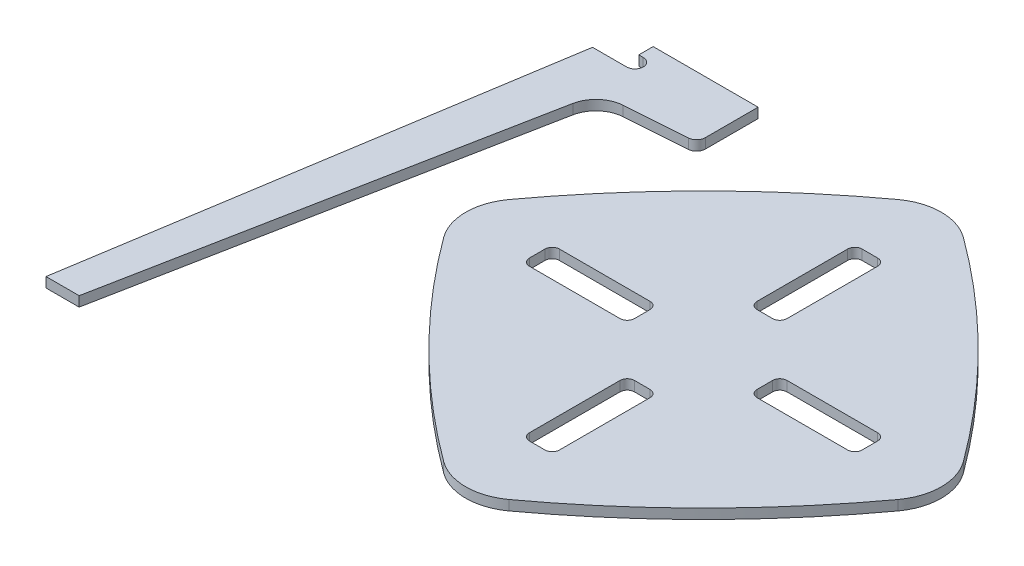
ISO-10303-21;
HEADER;
FILE_DESCRIPTION(('STEP AP214'),'2;1');
FILE_NAME('part.step','',(''),(''),'','','');
FILE_SCHEMA(('AUTOMOTIVE_DESIGN { 1 0 10303 214 1 1 1 1 }'));
ENDSEC;
DATA;
#1=APPLICATION_CONTEXT('core data for automotive mechanical design processes');
#2=APPLICATION_PROTOCOL_DEFINITION('international standard','automotive_design',2000,#1);
#3=PRODUCT_CONTEXT('',#1,'mechanical');
#4=PRODUCT('Part','Part','',(#3));
#5=PRODUCT_RELATED_PRODUCT_CATEGORY('part','',(#4));
#6=PRODUCT_DEFINITION_FORMATION('','',#4);
#7=PRODUCT_DEFINITION_CONTEXT('part definition',#1,'design');
#8=PRODUCT_DEFINITION('design','',#6,#7);
#9=PRODUCT_DEFINITION_SHAPE('','',#8);
#10=(LENGTH_UNIT() NAMED_UNIT(*) SI_UNIT(.MILLI.,.METRE.));
#11=(NAMED_UNIT(*) PLANE_ANGLE_UNIT() SI_UNIT($,.RADIAN.));
#12=(NAMED_UNIT(*) SI_UNIT($,.STERADIAN.) SOLID_ANGLE_UNIT());
#13=UNCERTAINTY_MEASURE_WITH_UNIT(LENGTH_MEASURE(1.E-05),#10,'distance_accuracy_value','');
#14=(GEOMETRIC_REPRESENTATION_CONTEXT(3) GLOBAL_UNCERTAINTY_ASSIGNED_CONTEXT((#13)) GLOBAL_UNIT_ASSIGNED_CONTEXT((#10,
#11,#12)) REPRESENTATION_CONTEXT('',''));
#15=CARTESIAN_POINT('',(0.,0.,0.));
#16=DIRECTION('',(0.,0.,1.));
#17=DIRECTION('',(1.,0.,0.));
#18=AXIS2_PLACEMENT_3D('',#15,#16,#17);
#19=CARTESIAN_POINT('',(-260.242769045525,152.125,-214.642789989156));
#20=DIRECTION('',(1.,0.,0.));
#21=DIRECTION('',(0.,0.,-1.));
#22=AXIS2_PLACEMENT_3D('',#19,#20,#21);
#23=PLANE('',#22);
#24=DIRECTION('',(0.,0.,1.));
#25=VECTOR('',#24,1.);
#26=CARTESIAN_POINT('',(-260.242769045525,143.125,-214.642789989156));
#27=LINE('',#26,#25);
#28=CARTESIAN_POINT('',(-260.242769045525,143.125,-214.642789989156));
#29=VERTEX_POINT('',#28);
#30=CARTESIAN_POINT('',(-260.242769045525,143.125,-201.642789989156));
#31=VERTEX_POINT('',#30);
#32=EDGE_CURVE('E174',#29,#31,#27,.T.);
#33=ORIENTED_EDGE('',*,*,#32,.T.);
#34=DIRECTION('',(0.,-1.,0.));
#35=VECTOR('',#34,1.);
#36=CARTESIAN_POINT('',(-260.242769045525,152.125,-201.642789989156));
#37=LINE('',#36,#35);
#38=CARTESIAN_POINT('',(-260.242769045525,152.125,-201.642789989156));
#39=VERTEX_POINT('',#38);
#40=EDGE_CURVE('E12',#39,#31,#37,.T.);
#41=ORIENTED_EDGE('',*,*,#40,.F.);
#42=DIRECTION('',(0.,0.,1.));
#43=VECTOR('',#42,1.);
#44=CARTESIAN_POINT('',(-260.242769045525,152.125,-214.642789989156));
#45=LINE('',#44,#43);
#46=CARTESIAN_POINT('',(-260.242769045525,152.125,-214.642789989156));
#47=VERTEX_POINT('',#46);
#48=EDGE_CURVE('E197',#47,#39,#45,.T.);
#49=ORIENTED_EDGE('',*,*,#48,.F.);
#50=DIRECTION('',(0.,-1.,0.));
#51=VECTOR('',#50,1.);
#52=CARTESIAN_POINT('',(-260.242769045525,152.125,-214.642789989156));
#53=LINE('',#52,#51);
#54=EDGE_CURVE('E170',#47,#29,#53,.T.);
#55=ORIENTED_EDGE('',*,*,#54,.T.);
#56=EDGE_LOOP('',(#33,#41,#49,#55));
#57=FACE_BOUND('',#56,.T.);
#58=ADVANCED_FACE('F54',(#57),#23,.F.);
#59=CARTESIAN_POINT('',(-256.242769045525,152.125,-201.642789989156));
#60=DIRECTION('',(0.,0.,-1.));
#61=DIRECTION('',(-1.,0.,0.));
#62=AXIS2_PLACEMENT_3D('',#59,#60,#61);
#63=PLANE('',#62);
#64=DIRECTION('',(1.,0.,0.));
#65=VECTOR('',#64,1.);
#66=CARTESIAN_POINT('',(-256.242769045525,143.125,-201.642789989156));
#67=LINE('',#66,#65);
#68=CARTESIAN_POINT('',(-256.242769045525,143.125,-201.642789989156));
#69=VERTEX_POINT('',#68);
#70=EDGE_CURVE('E177',#31,#69,#67,.T.);
#71=ORIENTED_EDGE('',*,*,#70,.T.);
#72=DIRECTION('',(0.,-1.,0.));
#73=VECTOR('',#72,1.);
#74=CARTESIAN_POINT('',(-256.242769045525,152.125,-201.642789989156));
#75=LINE('',#74,#73);
#76=CARTESIAN_POINT('',(-256.242769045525,152.125,-201.642789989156));
#77=VERTEX_POINT('',#76);
#78=EDGE_CURVE('E62',#77,#69,#75,.T.);
#79=ORIENTED_EDGE('',*,*,#78,.F.);
#80=DIRECTION('',(1.,0.,0.));
#81=VECTOR('',#80,1.);
#82=CARTESIAN_POINT('',(-256.242769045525,152.125,-201.642789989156));
#83=LINE('',#82,#81);
#84=EDGE_CURVE('E125',#39,#77,#83,.T.);
#85=ORIENTED_EDGE('',*,*,#84,.F.);
#86=ORIENTED_EDGE('',*,*,#40,.T.);
#87=EDGE_LOOP('',(#71,#79,#85,#86));
#88=FACE_BOUND('',#87,.T.);
#89=ADVANCED_FACE('F274',(#88),#63,.F.);
#90=CARTESIAN_POINT('',(-256.242769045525,152.125,-194.142789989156));
#91=DIRECTION('',(0.,-1.,0.));
#92=DIRECTION('',(0.,0.,-1.));
#93=AXIS2_PLACEMENT_3D('',#90,#91,#92);
#94=CYLINDRICAL_SURFACE('',#93,7.50000000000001);
#95=CARTESIAN_POINT('',(-256.242769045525,143.125,-194.142789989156));
#96=DIRECTION('',(0.,-1.,0.));
#97=DIRECTION('',(0.,0.,1.));
#98=AXIS2_PLACEMENT_3D('',#95,#96,#97);
#99=CIRCLE('',#98,7.50000000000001);
#100=CARTESIAN_POINT('',(-256.242769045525,143.125,-186.642789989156));
#101=VERTEX_POINT('',#100);
#102=EDGE_CURVE('E179',#69,#101,#99,.T.);
#103=ORIENTED_EDGE('',*,*,#102,.T.);
#104=DIRECTION('',(0.,-1.,0.));
#105=VECTOR('',#104,1.);
#106=CARTESIAN_POINT('',(-256.242769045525,152.125,-186.642789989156));
#107=LINE('',#106,#105);
#108=CARTESIAN_POINT('',(-256.242769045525,152.125,-186.642789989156));
#109=VERTEX_POINT('',#108);
#110=EDGE_CURVE('E216',#109,#101,#107,.T.);
#111=ORIENTED_EDGE('',*,*,#110,.F.);
#112=CARTESIAN_POINT('',(-256.242769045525,152.125,-194.142789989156));
#113=DIRECTION('',(0.,-1.,0.));
#114=DIRECTION('',(0.,0.,1.));
#115=AXIS2_PLACEMENT_3D('',#112,#113,#114);
#116=CIRCLE('',#115,7.50000000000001);
#117=EDGE_CURVE('E224',#77,#109,#116,.T.);
#118=ORIENTED_EDGE('',*,*,#117,.F.);
#119=ORIENTED_EDGE('',*,*,#78,.T.);
#120=EDGE_LOOP('',(#103,#111,#118,#119));
#121=FACE_BOUND('',#120,.T.);
#122=ADVANCED_FACE('F222',(#121),#94,.F.);
#123=CARTESIAN_POINT('',(-260.242769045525,152.125,-186.642789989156));
#124=DIRECTION('',(0.,0.,1.));
#125=DIRECTION('',(1.,0.,0.));
#126=AXIS2_PLACEMENT_3D('',#123,#124,#125);
#127=PLANE('',#126);
#128=DIRECTION('',(-1.,0.,0.));
#129=VECTOR('',#128,1.);
#130=CARTESIAN_POINT('',(-260.242769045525,143.125,-186.642789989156));
#131=LINE('',#130,#129);
#132=CARTESIAN_POINT('',(-287.087527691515,143.125,-186.642789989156));
#133=VERTEX_POINT('',#132);
#134=EDGE_CURVE('E182',#101,#133,#131,.T.);
#135=ORIENTED_EDGE('',*,*,#134,.T.);
#136=DIRECTION('',(0.,-1.,0.));
#137=VECTOR('',#136,1.);
#138=CARTESIAN_POINT('',(-287.087527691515,152.125,-186.642789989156));
#139=LINE('',#138,#137);
#140=CARTESIAN_POINT('',(-287.087527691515,152.125,-186.642789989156));
#141=VERTEX_POINT('',#140);
#142=EDGE_CURVE('E213',#141,#133,#139,.T.);
#143=ORIENTED_EDGE('',*,*,#142,.F.);
#144=DIRECTION('',(-1.,0.,0.));
#145=VECTOR('',#144,1.);
#146=CARTESIAN_POINT('',(-260.242769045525,152.125,-186.642789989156));
#147=LINE('',#146,#145);
#148=EDGE_CURVE('E241',#109,#141,#147,.T.);
#149=ORIENTED_EDGE('',*,*,#148,.F.);
#150=ORIENTED_EDGE('',*,*,#110,.T.);
#151=EDGE_LOOP('',(#135,#143,#149,#150));
#152=FACE_BOUND('',#151,.T.);
#153=ADVANCED_FACE('F232',(#152),#127,.F.);
#154=CARTESIAN_POINT('',(-287.087527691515,152.125,-186.642789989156));
#155=DIRECTION('',(0.987679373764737,0.,0.156491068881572));
#156=DIRECTION('',(0.156491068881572,0.,-0.987679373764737));
#157=AXIS2_PLACEMENT_3D('',#154,#155,#156);
#158=PLANE('',#157);
#159=DIRECTION('',(-0.156491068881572,0.,0.987679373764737));
#160=VECTOR('',#159,1.);
#161=CARTESIAN_POINT('',(-287.087527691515,143.125,-186.642789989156));
#162=LINE('',#161,#160);
#163=CARTESIAN_POINT('',(-354.742769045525,143.125,240.357210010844));
#164=VERTEX_POINT('',#163);
#165=EDGE_CURVE('E184',#133,#164,#162,.T.);
#166=ORIENTED_EDGE('',*,*,#165,.T.);
#167=DIRECTION('',(0.,-1.,0.));
#168=VECTOR('',#167,1.);
#169=CARTESIAN_POINT('',(-354.742769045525,152.125,240.357210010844));
#170=LINE('',#169,#168);
#171=CARTESIAN_POINT('',(-354.742769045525,152.125,240.357210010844));
#172=VERTEX_POINT('',#171);
#173=EDGE_CURVE('E210',#172,#164,#170,.T.);
#174=ORIENTED_EDGE('',*,*,#173,.F.);
#175=DIRECTION('',(-0.156491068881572,0.,0.987679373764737));
#176=VECTOR('',#175,1.);
#177=CARTESIAN_POINT('',(-287.087527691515,152.125,-186.642789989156));
#178=LINE('',#177,#176);
#179=EDGE_CURVE('E238',#141,#172,#178,.T.);
#180=ORIENTED_EDGE('',*,*,#179,.F.);
#181=ORIENTED_EDGE('',*,*,#142,.T.);
#182=EDGE_LOOP('',(#166,#174,#180,#181));
#183=FACE_BOUND('',#182,.T.);
#184=ADVANCED_FACE('F236',(#183),#158,.F.);
#185=CARTESIAN_POINT('',(-354.742769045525,152.125,240.357210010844));
#186=DIRECTION('',(0.,0.,-1.));
#187=DIRECTION('',(-1.,0.,0.));
#188=AXIS2_PLACEMENT_3D('',#185,#186,#187);
#189=PLANE('',#188);
#190=DIRECTION('',(1.,0.,0.));
#191=VECTOR('',#190,1.);
#192=CARTESIAN_POINT('',(-354.742769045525,143.125,240.357210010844));
#193=LINE('',#192,#191);
#194=CARTESIAN_POINT('',(-324.742769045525,143.125,240.357210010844));
#195=VERTEX_POINT('',#194);
#196=EDGE_CURVE('E186',#164,#195,#193,.T.);
#197=ORIENTED_EDGE('',*,*,#196,.T.);
#198=DIRECTION('',(0.,-1.,0.));
#199=VECTOR('',#198,1.);
#200=CARTESIAN_POINT('',(-324.742769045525,152.125,240.357210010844));
#201=LINE('',#200,#199);
#202=CARTESIAN_POINT('',(-324.742769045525,152.125,240.357210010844));
#203=VERTEX_POINT('',#202);
#204=EDGE_CURVE('E207',#203,#195,#201,.T.);
#205=ORIENTED_EDGE('',*,*,#204,.F.);
#206=DIRECTION('',(1.,0.,0.));
#207=VECTOR('',#206,1.);
#208=CARTESIAN_POINT('',(-354.742769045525,152.125,240.357210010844));
#209=LINE('',#208,#207);
#210=EDGE_CURVE('E240',#172,#203,#209,.T.);
#211=ORIENTED_EDGE('',*,*,#210,.F.);
#212=ORIENTED_EDGE('',*,*,#173,.T.);
#213=EDGE_LOOP('',(#197,#205,#211,#212));
#214=FACE_BOUND('',#213,.T.);
#215=ADVANCED_FACE('F287',(#214),#189,.F.);
#216=CARTESIAN_POINT('',(-324.742769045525,152.125,240.357210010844));
#217=DIRECTION('',(-0.981627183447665,0.,-0.190808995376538));
#218=DIRECTION('',(-0.190808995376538,0.,0.981627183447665));
#219=AXIS2_PLACEMENT_3D('',#216,#217,#218);
#220=PLANE('',#219);
#221=DIRECTION('',(0.190808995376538,0.,-0.981627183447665));
#222=VECTOR('',#221,1.);
#223=CARTESIAN_POINT('',(-324.742769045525,143.125,240.357210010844));
#224=LINE('',#223,#222);
#225=CARTESIAN_POINT('',(-252.038147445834,143.125,-133.675643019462));
#226=VERTEX_POINT('',#225);
#227=EDGE_CURVE('E188',#195,#226,#224,.T.);
#228=ORIENTED_EDGE('',*,*,#227,.T.);
#229=DIRECTION('',(0.,-1.,0.));
#230=VECTOR('',#229,1.);
#231=CARTESIAN_POINT('',(-252.038147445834,152.125,-133.675643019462));
#232=LINE('',#231,#230);
#233=CARTESIAN_POINT('',(-252.038147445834,152.125,-133.675643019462));
#234=VERTEX_POINT('',#233);
#235=EDGE_CURVE('E204',#234,#226,#232,.T.);
#236=ORIENTED_EDGE('',*,*,#235,.F.);
#237=DIRECTION('',(0.190808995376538,0.,-0.981627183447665));
#238=VECTOR('',#237,1.);
#239=CARTESIAN_POINT('',(-324.742769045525,152.125,240.357210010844));
#240=LINE('',#239,#238);
#241=EDGE_CURVE('E243',#203,#234,#240,.T.);
#242=ORIENTED_EDGE('',*,*,#241,.F.);
#243=ORIENTED_EDGE('',*,*,#204,.T.);
#244=EDGE_LOOP('',(#228,#236,#242,#243));
#245=FACE_BOUND('',#244,.T.);
#246=ADVANCED_FACE('F290',(#245),#220,.F.);
#247=CARTESIAN_POINT('',(-226.025027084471,152.125,-128.619204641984));
#248=DIRECTION('',(0.,-1.,0.));
#249=DIRECTION('',(0.,0.,-1.));
#250=AXIS2_PLACEMENT_3D('',#247,#248,#249);
#251=CYLINDRICAL_SURFACE('',#250,26.5);
#252=CARTESIAN_POINT('',(-226.025027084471,143.125,-128.619204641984));
#253=DIRECTION('',(0.,-1.,0.));
#254=DIRECTION('',(0.,0.,1.));
#255=AXIS2_PLACEMENT_3D('',#252,#253,#254);
#256=CIRCLE('',#255,26.5);
#257=CARTESIAN_POINT('',(-227.87357363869,143.125,-155.054651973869));
#258=VERTEX_POINT('',#257);
#259=EDGE_CURVE('E190',#226,#258,#256,.T.);
#260=ORIENTED_EDGE('',*,*,#259,.T.);
#261=DIRECTION('',(0.,-1.,0.));
#262=VECTOR('',#261,1.);
#263=CARTESIAN_POINT('',(-227.87357363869,152.125,-155.054651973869));
#264=LINE('',#263,#262);
#265=CARTESIAN_POINT('',(-227.87357363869,152.125,-155.054651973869));
#266=VERTEX_POINT('',#265);
#267=EDGE_CURVE('E201',#266,#258,#264,.T.);
#268=ORIENTED_EDGE('',*,*,#267,.F.);
#269=CARTESIAN_POINT('',(-226.025027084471,152.125,-128.619204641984));
#270=DIRECTION('',(0.,-1.,0.));
#271=DIRECTION('',(0.,0.,1.));
#272=AXIS2_PLACEMENT_3D('',#269,#270,#271);
#273=CIRCLE('',#272,26.5);
#274=EDGE_CURVE('E249',#234,#266,#273,.T.);
#275=ORIENTED_EDGE('',*,*,#274,.F.);
#276=ORIENTED_EDGE('',*,*,#235,.T.);
#277=EDGE_LOOP('',(#260,#268,#275,#276));
#278=FACE_BOUND('',#277,.T.);
#279=ADVANCED_FACE('F255',(#278),#251,.F.);
#280=CARTESIAN_POINT('',(-172.684717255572,152.125,-158.913832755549));
#281=DIRECTION('',(-0.0697564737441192,0.,-0.997564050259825));
#282=DIRECTION('',(-0.997564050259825,0.,0.0697564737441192));
#283=AXIS2_PLACEMENT_3D('',#280,#281,#282);
#284=PLANE('',#283);
#285=DIRECTION('',(0.997564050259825,0.,-0.0697564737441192));
#286=VECTOR('',#285,1.);
#287=CARTESIAN_POINT('',(-172.684717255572,143.125,-158.913832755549));
#288=LINE('',#287,#286);
#289=CARTESIAN_POINT('',(-172.684717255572,143.125,-158.913832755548));
#290=VERTEX_POINT('',#289);
#291=EDGE_CURVE('E192',#258,#290,#288,.T.);
#292=ORIENTED_EDGE('',*,*,#291,.T.);
#293=DIRECTION('',(0.,-1.,0.));
#294=VECTOR('',#293,1.);
#295=CARTESIAN_POINT('',(-172.684717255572,152.125,-158.913832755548));
#296=LINE('',#295,#294);
#297=CARTESIAN_POINT('',(-172.684717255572,152.125,-158.913832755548));
#298=VERTEX_POINT('',#297);
#299=EDGE_CURVE('E165',#298,#290,#296,.T.);
#300=ORIENTED_EDGE('',*,*,#299,.F.);
#301=DIRECTION('',(0.997564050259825,0.,-0.0697564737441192));
#302=VECTOR('',#301,1.);
#303=CARTESIAN_POINT('',(-172.684717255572,152.125,-158.913832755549));
#304=LINE('',#303,#302);
#305=EDGE_CURVE('E156',#266,#298,#304,.T.);
#306=ORIENTED_EDGE('',*,*,#305,.F.);
#307=ORIENTED_EDGE('',*,*,#267,.T.);
#308=EDGE_LOOP('',(#292,#300,#306,#307));
#309=FACE_BOUND('',#308,.T.);
#310=ADVANCED_FACE('F259',(#309),#284,.F.);
#311=CARTESIAN_POINT('',(-173.242769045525,152.125,-166.894345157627));
#312=DIRECTION('',(0.,-1.,0.));
#313=DIRECTION('',(0.,0.,-1.));
#314=AXIS2_PLACEMENT_3D('',#311,#312,#313);
#315=CYLINDRICAL_SURFACE('',#314,7.99999999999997);
#316=CARTESIAN_POINT('',(-173.242769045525,143.125,-166.894345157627));
#317=DIRECTION('',(0.,1.,0.));
#318=DIRECTION('',(0.,0.,-1.));
#319=AXIS2_PLACEMENT_3D('',#316,#317,#318);
#320=CIRCLE('',#319,7.99999999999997);
#321=CARTESIAN_POINT('',(-165.242769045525,143.125,-166.894345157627));
#322=VERTEX_POINT('',#321);
#323=EDGE_CURVE('E164',#290,#322,#320,.T.);
#324=ORIENTED_EDGE('',*,*,#323,.T.);
#325=DIRECTION('',(0.,-1.,0.));
#326=VECTOR('',#325,1.);
#327=CARTESIAN_POINT('',(-165.242769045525,152.125,-166.894345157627));
#328=LINE('',#327,#326);
#329=CARTESIAN_POINT('',(-165.242769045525,152.125,-166.894345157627));
#330=VERTEX_POINT('',#329);
#331=EDGE_CURVE('E161',#330,#322,#328,.T.);
#332=ORIENTED_EDGE('',*,*,#331,.F.);
#333=CARTESIAN_POINT('',(-173.242769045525,152.125,-166.894345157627));
#334=DIRECTION('',(0.,1.,0.));
#335=DIRECTION('',(0.,0.,-1.));
#336=AXIS2_PLACEMENT_3D('',#333,#334,#335);
#337=CIRCLE('',#336,7.99999999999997);
#338=EDGE_CURVE('E150',#298,#330,#337,.T.);
#339=ORIENTED_EDGE('',*,*,#338,.F.);
#340=ORIENTED_EDGE('',*,*,#299,.T.);
#341=EDGE_LOOP('',(#324,#332,#339,#340));
#342=FACE_BOUND('',#341,.T.);
#343=ADVANCED_FACE('F162',(#342),#315,.T.);
#344=CARTESIAN_POINT('',(-165.242769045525,152.125,-166.894345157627));
#345=DIRECTION('',(-1.,0.,0.));
#346=DIRECTION('',(0.,0.,1.));
#347=AXIS2_PLACEMENT_3D('',#344,#345,#346);
#348=PLANE('',#347);
#349=DIRECTION('',(0.,0.,-1.));
#350=VECTOR('',#349,1.);
#351=CARTESIAN_POINT('',(-165.242769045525,143.125,-166.894345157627));
#352=LINE('',#351,#350);
#353=CARTESIAN_POINT('',(-165.242769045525,143.125,-214.642789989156));
#354=VERTEX_POINT('',#353);
#355=EDGE_CURVE('E111',#322,#354,#352,.T.);
#356=ORIENTED_EDGE('',*,*,#355,.T.);
#357=DIRECTION('',(0.,-1.,0.));
#358=VECTOR('',#357,1.);
#359=CARTESIAN_POINT('',(-165.242769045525,152.125,-214.642789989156));
#360=LINE('',#359,#358);
#361=CARTESIAN_POINT('',(-165.242769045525,152.125,-214.642789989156));
#362=VERTEX_POINT('',#361);
#363=EDGE_CURVE('E166',#362,#354,#360,.T.);
#364=ORIENTED_EDGE('',*,*,#363,.F.);
#365=DIRECTION('',(0.,0.,-1.));
#366=VECTOR('',#365,1.);
#367=CARTESIAN_POINT('',(-165.242769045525,152.125,-166.894345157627));
#368=LINE('',#367,#366);
#369=EDGE_CURVE('E154',#330,#362,#368,.T.);
#370=ORIENTED_EDGE('',*,*,#369,.F.);
#371=ORIENTED_EDGE('',*,*,#331,.T.);
#372=EDGE_LOOP('',(#356,#364,#370,#371));
#373=FACE_BOUND('',#372,.T.);
#374=ADVANCED_FACE('F168',(#373),#348,.F.);
#375=CARTESIAN_POINT('',(-165.242769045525,152.125,-214.642789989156));
#376=DIRECTION('',(0.,0.,1.));
#377=DIRECTION('',(1.,0.,0.));
#378=AXIS2_PLACEMENT_3D('',#375,#376,#377);
#379=PLANE('',#378);
#380=DIRECTION('',(-1.,0.,0.));
#381=VECTOR('',#380,1.);
#382=CARTESIAN_POINT('',(-165.242769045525,143.125,-214.642789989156));
#383=LINE('',#382,#381);
#384=EDGE_CURVE('E117',#354,#29,#383,.T.);
#385=ORIENTED_EDGE('',*,*,#384,.T.);
#386=ORIENTED_EDGE('',*,*,#54,.F.);
#387=DIRECTION('',(-1.,0.,0.));
#388=VECTOR('',#387,1.);
#389=CARTESIAN_POINT('',(-165.242769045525,152.125,-214.642789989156));
#390=LINE('',#389,#388);
#391=EDGE_CURVE('E70',#362,#47,#390,.T.);
#392=ORIENTED_EDGE('',*,*,#391,.F.);
#393=ORIENTED_EDGE('',*,*,#363,.T.);
#394=EDGE_LOOP('',(#385,#386,#392,#393));
#395=FACE_BOUND('',#394,.T.);
#396=ADVANCED_FACE('F263',(#395),#379,.F.);
#397=CARTESIAN_POINT('',(-256.242769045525,152.125,-194.142789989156));
#398=DIRECTION('',(0.,1.,0.));
#399=DIRECTION('',(0.,0.,1.));
#400=AXIS2_PLACEMENT_3D('',#397,#398,#399);
#401=PLANE('',#400);
#402=ORIENTED_EDGE('',*,*,#48,.T.);
#403=ORIENTED_EDGE('',*,*,#84,.T.);
#404=ORIENTED_EDGE('',*,*,#117,.T.);
#405=ORIENTED_EDGE('',*,*,#148,.T.);
#406=ORIENTED_EDGE('',*,*,#179,.T.);
#407=ORIENTED_EDGE('',*,*,#210,.T.);
#408=ORIENTED_EDGE('',*,*,#241,.T.);
#409=ORIENTED_EDGE('',*,*,#274,.T.);
#410=ORIENTED_EDGE('',*,*,#305,.T.);
#411=ORIENTED_EDGE('',*,*,#338,.T.);
#412=ORIENTED_EDGE('',*,*,#369,.T.);
#413=ORIENTED_EDGE('',*,*,#391,.T.);
#414=EDGE_LOOP('',(#402,#403,#404,#405,#406,#407,#408,#409,#410,#411,#412,#413));
#415=FACE_BOUND('',#414,.T.);
#416=ADVANCED_FACE('F152',(#415),#401,.T.);
#417=CARTESIAN_POINT('',(-256.242769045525,143.125,-194.142789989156));
#418=DIRECTION('',(0.,1.,0.));
#419=DIRECTION('',(0.,0.,1.));
#420=AXIS2_PLACEMENT_3D('',#417,#418,#419);
#421=PLANE('',#420);
#422=ORIENTED_EDGE('',*,*,#32,.F.);
#423=ORIENTED_EDGE('',*,*,#384,.F.);
#424=ORIENTED_EDGE('',*,*,#355,.F.);
#425=ORIENTED_EDGE('',*,*,#323,.F.);
#426=ORIENTED_EDGE('',*,*,#291,.F.);
#427=ORIENTED_EDGE('',*,*,#259,.F.);
#428=ORIENTED_EDGE('',*,*,#227,.F.);
#429=ORIENTED_EDGE('',*,*,#196,.F.);
#430=ORIENTED_EDGE('',*,*,#165,.F.);
#431=ORIENTED_EDGE('',*,*,#134,.F.);
#432=ORIENTED_EDGE('',*,*,#102,.F.);
#433=ORIENTED_EDGE('',*,*,#70,.F.);
#434=EDGE_LOOP('',(#422,#423,#424,#425,#426,#427,#428,#429,#430,#431,#432,#433));
#435=FACE_BOUND('',#434,.T.);
#436=ADVANCED_FACE('F227',(#435),#421,.F.);
#437=CLOSED_SHELL('',(#58,#89,#122,#153,#184,#215,#246,#279,#310,#343,#374,#396,#416,#436));
#438=MANIFOLD_SOLID_BREP('B2',#437);
#439=CARTESIAN_POINT('',(165.242769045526,152.125,0.));
#440=DIRECTION('',(0.,-1.,0.));
#441=DIRECTION('',(0.,0.,-1.));
#442=AXIS2_PLACEMENT_3D('',#439,#440,#441);
#443=CYLINDRICAL_SURFACE('',#442,49.9999999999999);
#444=CARTESIAN_POINT('',(165.242769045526,143.125,0.));
#445=DIRECTION('',(0.,1.,0.));
#446=DIRECTION('',(0.,0.,-1.));
#447=AXIS2_PLACEMENT_3D('',#444,#445,#446);
#448=CIRCLE('',#447,49.9999999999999);
#449=CARTESIAN_POINT('',(205.553702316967,143.125,29.58088333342));
#450=VERTEX_POINT('',#449);
#451=CARTESIAN_POINT('',(205.553702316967,143.125,-29.5808833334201));
#452=VERTEX_POINT('',#451);
#453=EDGE_CURVE('E693',#450,#452,#448,.T.);
#454=ORIENTED_EDGE('',*,*,#453,.T.);
#455=DIRECTION('',(0.,-1.,0.));
#456=VECTOR('',#455,1.);
#457=CARTESIAN_POINT('',(205.553702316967,152.125,-29.5808833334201));
#458=LINE('',#457,#456);
#459=CARTESIAN_POINT('',(205.553702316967,152.125,-29.5808833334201));
#460=VERTEX_POINT('',#459);
#461=EDGE_CURVE('E876',#460,#452,#458,.T.);
#462=ORIENTED_EDGE('',*,*,#461,.F.);
#463=CARTESIAN_POINT('',(165.242769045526,152.125,0.));
#464=DIRECTION('',(0.,1.,0.));
#465=DIRECTION('',(0.,0.,-1.));
#466=AXIS2_PLACEMENT_3D('',#463,#464,#465);
#467=CIRCLE('',#466,49.9999999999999);
#468=CARTESIAN_POINT('',(205.553702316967,152.125,29.58088333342));
#469=VERTEX_POINT('',#468);
#470=EDGE_CURVE('E822',#469,#460,#467,.T.);
#471=ORIENTED_EDGE('',*,*,#470,.F.);
#472=DIRECTION('',(0.,-1.,0.));
#473=VECTOR('',#472,1.);
#474=CARTESIAN_POINT('',(205.553702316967,152.125,29.58088333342));
#475=LINE('',#474,#473);
#476=EDGE_CURVE('E840',#469,#450,#475,.T.);
#477=ORIENTED_EDGE('',*,*,#476,.T.);
#478=EDGE_LOOP('',(#454,#462,#471,#477));
#479=FACE_BOUND('',#478,.T.);
#480=ADVANCED_FACE('F394',(#479),#443,.T.);
#481=CARTESIAN_POINT('',(-455.54560333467,152.125,455.545603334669));
#482=DIRECTION('',(0.,-1.,0.));
#483=DIRECTION('',(0.,0.,-1.));
#484=AXIS2_PLACEMENT_3D('',#481,#482,#483);
#485=CYLINDRICAL_SURFACE('',#484,820.);
#486=CARTESIAN_POINT('',(-455.54560333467,143.125,455.545603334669));
#487=DIRECTION('',(0.,1.,0.));
#488=DIRECTION('',(0.,0.,-1.));
#489=AXIS2_PLACEMENT_3D('',#486,#487,#488);
#490=CIRCLE('',#489,820.);
#491=CARTESIAN_POINT('',(29.5808833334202,143.125,-205.553702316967));
#492=VERTEX_POINT('',#491);
#493=EDGE_CURVE('E843',#452,#492,#490,.T.);
#494=ORIENTED_EDGE('',*,*,#493,.T.);
#495=DIRECTION('',(0.,-1.,0.));
#496=VECTOR('',#495,1.);
#497=CARTESIAN_POINT('',(29.5808833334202,152.125,-205.553702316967));
#498=LINE('',#497,#496);
#499=CARTESIAN_POINT('',(29.5808833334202,152.125,-205.553702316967));
#500=VERTEX_POINT('',#499);
#501=EDGE_CURVE('E873',#500,#492,#498,.T.);
#502=ORIENTED_EDGE('',*,*,#501,.F.);
#503=CARTESIAN_POINT('',(-455.54560333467,152.125,455.545603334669));
#504=DIRECTION('',(0.,1.,0.));
#505=DIRECTION('',(0.,0.,-1.));
#506=AXIS2_PLACEMENT_3D('',#503,#504,#505);
#507=CIRCLE('',#506,820.);
#508=EDGE_CURVE('E825',#460,#500,#507,.T.);
#509=ORIENTED_EDGE('',*,*,#508,.F.);
#510=ORIENTED_EDGE('',*,*,#461,.T.);
#511=EDGE_LOOP('',(#494,#502,#509,#510));
#512=FACE_BOUND('',#511,.T.);
#513=ADVANCED_FACE('F982',(#512),#485,.T.);
#514=CARTESIAN_POINT('',(1.73878233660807E-13,152.125,-165.242769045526));
#515=DIRECTION('',(0.,-1.,0.));
#516=DIRECTION('',(0.,0.,-1.));
#517=AXIS2_PLACEMENT_3D('',#514,#515,#516);
#518=CYLINDRICAL_SURFACE('',#517,50.);
#519=CARTESIAN_POINT('',(1.73878233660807E-13,143.125,-165.242769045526));
#520=DIRECTION('',(0.,1.,0.));
#521=DIRECTION('',(0.,0.,-1.));
#522=AXIS2_PLACEMENT_3D('',#519,#520,#521);
#523=CIRCLE('',#522,50.);
#524=CARTESIAN_POINT('',(-29.5808833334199,143.125,-205.553702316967));
#525=VERTEX_POINT('',#524);
#526=EDGE_CURVE('E845',#492,#525,#523,.T.);
#527=ORIENTED_EDGE('',*,*,#526,.T.);
#528=DIRECTION('',(0.,-1.,0.));
#529=VECTOR('',#528,1.);
#530=CARTESIAN_POINT('',(-29.5808833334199,152.125,-205.553702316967));
#531=LINE('',#530,#529);
#532=CARTESIAN_POINT('',(-29.5808833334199,152.125,-205.553702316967));
#533=VERTEX_POINT('',#532);
#534=EDGE_CURVE('E870',#533,#525,#531,.T.);
#535=ORIENTED_EDGE('',*,*,#534,.F.);
#536=CARTESIAN_POINT('',(1.73878233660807E-13,152.125,-165.242769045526));
#537=DIRECTION('',(0.,1.,0.));
#538=DIRECTION('',(0.,0.,-1.));
#539=AXIS2_PLACEMENT_3D('',#536,#537,#538);
#540=CIRCLE('',#539,50.);
#541=EDGE_CURVE('E828',#500,#533,#540,.T.);
#542=ORIENTED_EDGE('',*,*,#541,.F.);
#543=ORIENTED_EDGE('',*,*,#501,.T.);
#544=EDGE_LOOP('',(#527,#535,#542,#543));
#545=FACE_BOUND('',#544,.T.);
#546=ADVANCED_FACE('F987',(#545),#518,.T.);
#547=CARTESIAN_POINT('',(455.545603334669,152.125,455.54560333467));
#548=DIRECTION('',(0.,-1.,0.));
#549=DIRECTION('',(0.,0.,-1.));
#550=AXIS2_PLACEMENT_3D('',#547,#548,#549);
#551=CYLINDRICAL_SURFACE('',#550,820.);
#552=CARTESIAN_POINT('',(455.545603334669,143.125,455.54560333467));
#553=DIRECTION('',(0.,1.,0.));
#554=DIRECTION('',(0.,0.,-1.));
#555=AXIS2_PLACEMENT_3D('',#552,#553,#554);
#556=CIRCLE('',#555,820.);
#557=CARTESIAN_POINT('',(-205.553702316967,143.125,-29.58088333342));
#558=VERTEX_POINT('',#557);
#559=EDGE_CURVE('E847',#525,#558,#556,.T.);
#560=ORIENTED_EDGE('',*,*,#559,.T.);
#561=DIRECTION('',(0.,-1.,0.));
#562=VECTOR('',#561,1.);
#563=CARTESIAN_POINT('',(-205.553702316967,152.125,-29.58088333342));
#564=LINE('',#563,#562);
#565=CARTESIAN_POINT('',(-205.553702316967,152.125,-29.58088333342));
#566=VERTEX_POINT('',#565);
#567=EDGE_CURVE('E867',#566,#558,#564,.T.);
#568=ORIENTED_EDGE('',*,*,#567,.F.);
#569=CARTESIAN_POINT('',(455.545603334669,152.125,455.54560333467));
#570=DIRECTION('',(0.,1.,0.));
#571=DIRECTION('',(0.,0.,-1.));
#572=AXIS2_PLACEMENT_3D('',#569,#570,#571);
#573=CIRCLE('',#572,820.);
#574=EDGE_CURVE('E830',#533,#566,#573,.T.);
#575=ORIENTED_EDGE('',*,*,#574,.F.);
#576=ORIENTED_EDGE('',*,*,#534,.T.);
#577=EDGE_LOOP('',(#560,#568,#575,#576));
#578=FACE_BOUND('',#577,.T.);
#579=ADVANCED_FACE('F1021',(#578),#551,.T.);
#580=CARTESIAN_POINT('',(-165.242769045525,152.125,0.));
#581=DIRECTION('',(0.,-1.,0.));
#582=DIRECTION('',(0.,0.,-1.));
#583=AXIS2_PLACEMENT_3D('',#580,#581,#582);
#584=CYLINDRICAL_SURFACE('',#583,50.0000000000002);
#585=CARTESIAN_POINT('',(-165.242769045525,143.125,0.));
#586=DIRECTION('',(0.,1.,0.));
#587=DIRECTION('',(0.,0.,1.));
#588=AXIS2_PLACEMENT_3D('',#585,#586,#587);
#589=CIRCLE('',#588,50.0000000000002);
#590=CARTESIAN_POINT('',(-205.553702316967,143.125,29.5808833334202));
#591=VERTEX_POINT('',#590);
#592=EDGE_CURVE('E849',#558,#591,#589,.T.);
#593=ORIENTED_EDGE('',*,*,#592,.T.);
#594=DIRECTION('',(0.,-1.,0.));
#595=VECTOR('',#594,1.);
#596=CARTESIAN_POINT('',(-205.553702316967,152.125,29.5808833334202));
#597=LINE('',#596,#595);
#598=CARTESIAN_POINT('',(-205.553702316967,152.125,29.5808833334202));
#599=VERTEX_POINT('',#598);
#600=EDGE_CURVE('E864',#599,#591,#597,.T.);
#601=ORIENTED_EDGE('',*,*,#600,.F.);
#602=CARTESIAN_POINT('',(-165.242769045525,152.125,0.));
#603=DIRECTION('',(0.,1.,0.));
#604=DIRECTION('',(0.,0.,1.));
#605=AXIS2_PLACEMENT_3D('',#602,#603,#604);
#606=CIRCLE('',#605,50.0000000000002);
#607=EDGE_CURVE('E832',#566,#599,#606,.T.);
#608=ORIENTED_EDGE('',*,*,#607,.F.);
#609=ORIENTED_EDGE('',*,*,#567,.T.);
#610=EDGE_LOOP('',(#593,#601,#608,#609));
#611=FACE_BOUND('',#610,.T.);
#612=ADVANCED_FACE('F1017',(#611),#584,.T.);
#613=CARTESIAN_POINT('',(455.54560333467,152.125,-455.545603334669));
#614=DIRECTION('',(0.,-1.,0.));
#615=DIRECTION('',(0.,0.,-1.));
#616=AXIS2_PLACEMENT_3D('',#613,#614,#615);
#617=CYLINDRICAL_SURFACE('',#616,820.);
#618=CARTESIAN_POINT('',(455.54560333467,143.125,-455.545603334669));
#619=DIRECTION('',(0.,1.,0.));
#620=DIRECTION('',(0.,0.,-1.));
#621=AXIS2_PLACEMENT_3D('',#618,#619,#620);
#622=CIRCLE('',#621,820.);
#623=CARTESIAN_POINT('',(-29.5808833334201,143.125,205.553702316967));
#624=VERTEX_POINT('',#623);
#625=EDGE_CURVE('E851',#591,#624,#622,.T.);
#626=ORIENTED_EDGE('',*,*,#625,.T.);
#627=DIRECTION('',(0.,-1.,0.));
#628=VECTOR('',#627,1.);
#629=CARTESIAN_POINT('',(-29.5808833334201,152.125,205.553702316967));
#630=LINE('',#629,#628);
#631=CARTESIAN_POINT('',(-29.5808833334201,152.125,205.553702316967));
#632=VERTEX_POINT('',#631);
#633=EDGE_CURVE('E861',#632,#624,#630,.T.);
#634=ORIENTED_EDGE('',*,*,#633,.F.);
#635=CARTESIAN_POINT('',(455.54560333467,152.125,-455.545603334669));
#636=DIRECTION('',(0.,1.,0.));
#637=DIRECTION('',(0.,0.,-1.));
#638=AXIS2_PLACEMENT_3D('',#635,#636,#637);
#639=CIRCLE('',#638,820.);
#640=EDGE_CURVE('E834',#599,#632,#639,.T.);
#641=ORIENTED_EDGE('',*,*,#640,.F.);
#642=ORIENTED_EDGE('',*,*,#600,.T.);
#643=EDGE_LOOP('',(#626,#634,#641,#642));
#644=FACE_BOUND('',#643,.T.);
#645=ADVANCED_FACE('F1012',(#644),#617,.T.);
#646=CARTESIAN_POINT('',(-1.6381028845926E-13,152.125,165.242769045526));
#647=DIRECTION('',(0.,-1.,0.));
#648=DIRECTION('',(0.,0.,-1.));
#649=AXIS2_PLACEMENT_3D('',#646,#647,#648);
#650=CYLINDRICAL_SURFACE('',#649,49.9999999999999);
#651=CARTESIAN_POINT('',(-1.6381028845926E-13,143.125,165.242769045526));
#652=DIRECTION('',(0.,1.,0.));
#653=DIRECTION('',(0.,0.,-1.));
#654=AXIS2_PLACEMENT_3D('',#651,#652,#653);
#655=CIRCLE('',#654,49.9999999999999);
#656=CARTESIAN_POINT('',(29.5808833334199,143.125,205.553702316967));
#657=VERTEX_POINT('',#656);
#658=EDGE_CURVE('E853',#624,#657,#655,.T.);
#659=ORIENTED_EDGE('',*,*,#658,.T.);
#660=DIRECTION('',(0.,-1.,0.));
#661=VECTOR('',#660,1.);
#662=CARTESIAN_POINT('',(29.5808833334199,152.125,205.553702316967));
#663=LINE('',#662,#661);
#664=CARTESIAN_POINT('',(29.5808833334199,152.125,205.553702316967));
#665=VERTEX_POINT('',#664);
#666=EDGE_CURVE('E858',#665,#657,#663,.T.);
#667=ORIENTED_EDGE('',*,*,#666,.F.);
#668=CARTESIAN_POINT('',(-1.6381028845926E-13,152.125,165.242769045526));
#669=DIRECTION('',(0.,1.,0.));
#670=DIRECTION('',(0.,0.,-1.));
#671=AXIS2_PLACEMENT_3D('',#668,#669,#670);
#672=CIRCLE('',#671,49.9999999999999);
#673=EDGE_CURVE('E836',#632,#665,#672,.T.);
#674=ORIENTED_EDGE('',*,*,#673,.F.);
#675=ORIENTED_EDGE('',*,*,#633,.T.);
#676=EDGE_LOOP('',(#659,#667,#674,#675));
#677=FACE_BOUND('',#676,.T.);
#678=ADVANCED_FACE('F1007',(#677),#650,.T.);
#679=CARTESIAN_POINT('',(-455.54560333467,152.125,-455.54560333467));
#680=DIRECTION('',(0.,-1.,0.));
#681=DIRECTION('',(0.,0.,-1.));
#682=AXIS2_PLACEMENT_3D('',#679,#680,#681);
#683=CYLINDRICAL_SURFACE('',#682,820.);
#684=CARTESIAN_POINT('',(-455.54560333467,143.125,-455.54560333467));
#685=DIRECTION('',(0.,1.,0.));
#686=DIRECTION('',(0.,0.,-1.));
#687=AXIS2_PLACEMENT_3D('',#684,#685,#686);
#688=CIRCLE('',#687,820.);
#689=EDGE_CURVE('E826',#657,#450,#688,.T.);
#690=ORIENTED_EDGE('',*,*,#689,.T.);
#691=ORIENTED_EDGE('',*,*,#476,.F.);
#692=CARTESIAN_POINT('',(-455.54560333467,152.125,-455.54560333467));
#693=DIRECTION('',(0.,1.,0.));
#694=DIRECTION('',(0.,0.,-1.));
#695=AXIS2_PLACEMENT_3D('',#692,#693,#694);
#696=CIRCLE('',#695,820.);
#697=EDGE_CURVE('E838',#665,#469,#696,.T.);
#698=ORIENTED_EDGE('',*,*,#697,.F.);
#699=ORIENTED_EDGE('',*,*,#666,.T.);
#700=EDGE_LOOP('',(#690,#691,#698,#699));
#701=FACE_BOUND('',#700,.T.);
#702=ADVANCED_FACE('F1005',(#701),#683,.T.);
#703=CARTESIAN_POINT('',(-145.151417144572,152.125,-227.772801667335));
#704=DIRECTION('',(0.,-1.,0.));
#705=DIRECTION('',(0.,0.,-1.));
#706=AXIS2_PLACEMENT_3D('',#703,#704,#705);
#707=PLANE('',#706);
#708=DIRECTION('',(1.,0.,0.));
#709=VECTOR('',#708,1.);
#710=CARTESIAN_POINT('',(62.,152.125,13.55));
#711=LINE('',#710,#709);
#712=CARTESIAN_POINT('',(62.,152.125,13.55));
#713=VERTEX_POINT('',#712);
#714=CARTESIAN_POINT('',(144.,152.125,13.55));
#715=VERTEX_POINT('',#714);
#716=EDGE_CURVE('E666',#713,#715,#711,.T.);
#717=ORIENTED_EDGE('',*,*,#716,.F.);
#718=CARTESIAN_POINT('',(62.,152.125,7.05));
#719=DIRECTION('',(0.,1.,0.));
#720=DIRECTION('',(0.,0.,1.));
#721=AXIS2_PLACEMENT_3D('',#718,#719,#720);
#722=CIRCLE('',#721,6.5);
#723=CARTESIAN_POINT('',(55.5,152.125,7.05));
#724=VERTEX_POINT('',#723);
#725=EDGE_CURVE('E408',#724,#713,#722,.T.);
#726=ORIENTED_EDGE('',*,*,#725,.F.);
#727=DIRECTION('',(0.,0.,1.));
#728=VECTOR('',#727,1.);
#729=CARTESIAN_POINT('',(55.5,152.125,7.05));
#730=LINE('',#729,#728);
#731=CARTESIAN_POINT('',(55.5,152.125,-7.05));
#732=VERTEX_POINT('',#731);
#733=EDGE_CURVE('E688',#732,#724,#730,.T.);
#734=ORIENTED_EDGE('',*,*,#733,.F.);
#735=CARTESIAN_POINT('',(62.,152.125,-7.05));
#736=DIRECTION('',(0.,1.,0.));
#737=DIRECTION('',(0.,0.,1.));
#738=AXIS2_PLACEMENT_3D('',#735,#736,#737);
#739=CIRCLE('',#738,6.5);
#740=CARTESIAN_POINT('',(62.,152.125,-13.55));
#741=VERTEX_POINT('',#740);
#742=EDGE_CURVE('E685',#741,#732,#739,.T.);
#743=ORIENTED_EDGE('',*,*,#742,.F.);
#744=DIRECTION('',(-1.,0.,0.));
#745=VECTOR('',#744,1.);
#746=CARTESIAN_POINT('',(62.,152.125,-13.55));
#747=LINE('',#746,#745);
#748=CARTESIAN_POINT('',(144.,152.125,-13.55));
#749=VERTEX_POINT('',#748);
#750=EDGE_CURVE('E682',#749,#741,#747,.T.);
#751=ORIENTED_EDGE('',*,*,#750,.F.);
#752=CARTESIAN_POINT('',(144.,152.125,-7.05));
#753=DIRECTION('',(0.,1.,0.));
#754=DIRECTION('',(0.,0.,1.));
#755=AXIS2_PLACEMENT_3D('',#752,#753,#754);
#756=CIRCLE('',#755,6.5);
#757=CARTESIAN_POINT('',(150.5,152.125,-7.05));
#758=VERTEX_POINT('',#757);
#759=EDGE_CURVE('E676',#758,#749,#756,.T.);
#760=ORIENTED_EDGE('',*,*,#759,.F.);
#761=DIRECTION('',(0.,0.,-1.));
#762=VECTOR('',#761,1.);
#763=CARTESIAN_POINT('',(150.5,152.125,7.05));
#764=LINE('',#763,#762);
#765=CARTESIAN_POINT('',(150.5,152.125,7.05));
#766=VERTEX_POINT('',#765);
#767=EDGE_CURVE('E674',#766,#758,#764,.T.);
#768=ORIENTED_EDGE('',*,*,#767,.F.);
#769=CARTESIAN_POINT('',(144.,152.125,7.05));
#770=DIRECTION('',(0.,1.,0.));
#771=DIRECTION('',(0.,0.,1.));
#772=AXIS2_PLACEMENT_3D('',#769,#770,#771);
#773=CIRCLE('',#772,6.5);
#774=EDGE_CURVE('E656',#715,#766,#773,.T.);
#775=ORIENTED_EDGE('',*,*,#774,.F.);
#776=EDGE_LOOP('',(#717,#726,#734,#743,#751,#760,#768,#775));
#777=FACE_BOUND('',#776,.T.);
#778=DIRECTION('',(0.,0.,1.));
#779=VECTOR('',#778,1.);
#780=CARTESIAN_POINT('',(-13.55,152.125,62.));
#781=LINE('',#780,#779);
#782=CARTESIAN_POINT('',(-13.55,152.125,62.));
#783=VERTEX_POINT('',#782);
#784=CARTESIAN_POINT('',(-13.55,152.125,144.));
#785=VERTEX_POINT('',#784);
#786=EDGE_CURVE('E705',#783,#785,#781,.T.);
#787=ORIENTED_EDGE('',*,*,#786,.F.);
#788=CARTESIAN_POINT('',(-7.05,152.125,62.));
#789=DIRECTION('',(0.,1.,0.));
#790=DIRECTION('',(0.,0.,1.));
#791=AXIS2_PLACEMENT_3D('',#788,#789,#790);
#792=CIRCLE('',#791,6.5);
#793=CARTESIAN_POINT('',(-7.05,152.125,55.5));
#794=VERTEX_POINT('',#793);
#795=EDGE_CURVE('E416',#794,#783,#792,.T.);
#796=ORIENTED_EDGE('',*,*,#795,.F.);
#797=DIRECTION('',(-1.,0.,0.));
#798=VECTOR('',#797,1.);
#799=CARTESIAN_POINT('',(-7.05,152.125,55.5));
#800=LINE('',#799,#798);
#801=CARTESIAN_POINT('',(7.05000000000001,152.125,55.5));
#802=VERTEX_POINT('',#801);
#803=EDGE_CURVE('E724',#802,#794,#800,.T.);
#804=ORIENTED_EDGE('',*,*,#803,.F.);
#805=CARTESIAN_POINT('',(7.05000000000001,152.125,62.));
#806=DIRECTION('',(0.,1.,0.));
#807=DIRECTION('',(0.,0.,1.));
#808=AXIS2_PLACEMENT_3D('',#805,#806,#807);
#809=CIRCLE('',#808,6.5);
#810=CARTESIAN_POINT('',(13.55,152.125,62.));
#811=VERTEX_POINT('',#810);
#812=EDGE_CURVE('E721',#811,#802,#809,.T.);
#813=ORIENTED_EDGE('',*,*,#812,.F.);
#814=DIRECTION('',(0.,0.,-1.));
#815=VECTOR('',#814,1.);
#816=CARTESIAN_POINT('',(13.55,152.125,62.));
#817=LINE('',#816,#815);
#818=CARTESIAN_POINT('',(13.55,152.125,144.));
#819=VERTEX_POINT('',#818);
#820=EDGE_CURVE('E718',#819,#811,#817,.T.);
#821=ORIENTED_EDGE('',*,*,#820,.F.);
#822=CARTESIAN_POINT('',(7.05000000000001,152.125,144.));
#823=DIRECTION('',(0.,1.,0.));
#824=DIRECTION('',(0.,0.,1.));
#825=AXIS2_PLACEMENT_3D('',#822,#823,#824);
#826=CIRCLE('',#825,6.5);
#827=CARTESIAN_POINT('',(7.05000000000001,152.125,150.5));
#828=VERTEX_POINT('',#827);
#829=EDGE_CURVE('E715',#828,#819,#826,.T.);
#830=ORIENTED_EDGE('',*,*,#829,.F.);
#831=DIRECTION('',(1.,0.,0.));
#832=VECTOR('',#831,1.);
#833=CARTESIAN_POINT('',(-7.04999999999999,152.125,150.5));
#834=LINE('',#833,#832);
#835=CARTESIAN_POINT('',(-7.04999999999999,152.125,150.5));
#836=VERTEX_POINT('',#835);
#837=EDGE_CURVE('E712',#836,#828,#834,.T.);
#838=ORIENTED_EDGE('',*,*,#837,.F.);
#839=CARTESIAN_POINT('',(-7.04999999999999,152.125,144.));
#840=DIRECTION('',(0.,1.,0.));
#841=DIRECTION('',(0.,0.,1.));
#842=AXIS2_PLACEMENT_3D('',#839,#840,#841);
#843=CIRCLE('',#842,6.5);
#844=EDGE_CURVE('E709',#785,#836,#843,.T.);
#845=ORIENTED_EDGE('',*,*,#844,.F.);
#846=EDGE_LOOP('',(#787,#796,#804,#813,#821,#830,#838,#845));
#847=FACE_BOUND('',#846,.T.);
#848=DIRECTION('',(-1.,0.,0.));
#849=VECTOR('',#848,1.);
#850=CARTESIAN_POINT('',(-62.,152.125,-13.55));
#851=LINE('',#850,#849);
#852=CARTESIAN_POINT('',(-62.,152.125,-13.55));
#853=VERTEX_POINT('',#852);
#854=CARTESIAN_POINT('',(-144.,152.125,-13.55));
#855=VERTEX_POINT('',#854);
#856=EDGE_CURVE('E745',#853,#855,#851,.T.);
#857=ORIENTED_EDGE('',*,*,#856,.F.);
#858=CARTESIAN_POINT('',(-62.,152.125,-7.04999999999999));
#859=DIRECTION('',(0.,1.,0.));
#860=DIRECTION('',(0.,0.,1.));
#861=AXIS2_PLACEMENT_3D('',#858,#859,#860);
#862=CIRCLE('',#861,6.5);
#863=CARTESIAN_POINT('',(-55.5,152.125,-7.04999999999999));
#864=VERTEX_POINT('',#863);
#865=EDGE_CURVE('E743',#864,#853,#862,.T.);
#866=ORIENTED_EDGE('',*,*,#865,.F.);
#867=DIRECTION('',(0.,0.,-1.));
#868=VECTOR('',#867,1.);
#869=CARTESIAN_POINT('',(-55.5,152.125,-7.04999999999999));
#870=LINE('',#869,#868);
#871=CARTESIAN_POINT('',(-55.5,152.125,7.05000000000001));
#872=VERTEX_POINT('',#871);
#873=EDGE_CURVE('E764',#872,#864,#870,.T.);
#874=ORIENTED_EDGE('',*,*,#873,.F.);
#875=CARTESIAN_POINT('',(-62.,152.125,7.05000000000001));
#876=DIRECTION('',(0.,1.,0.));
#877=DIRECTION('',(0.,0.,1.));
#878=AXIS2_PLACEMENT_3D('',#875,#876,#877);
#879=CIRCLE('',#878,6.5);
#880=CARTESIAN_POINT('',(-62.,152.125,13.55));
#881=VERTEX_POINT('',#880);
#882=EDGE_CURVE('E761',#881,#872,#879,.T.);
#883=ORIENTED_EDGE('',*,*,#882,.F.);
#884=DIRECTION('',(1.,0.,0.));
#885=VECTOR('',#884,1.);
#886=CARTESIAN_POINT('',(-62.,152.125,13.55));
#887=LINE('',#886,#885);
#888=CARTESIAN_POINT('',(-144.,152.125,13.55));
#889=VERTEX_POINT('',#888);
#890=EDGE_CURVE('E758',#889,#881,#887,.T.);
#891=ORIENTED_EDGE('',*,*,#890,.F.);
#892=CARTESIAN_POINT('',(-144.,152.125,7.05000000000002));
#893=DIRECTION('',(0.,1.,0.));
#894=DIRECTION('',(0.,0.,1.));
#895=AXIS2_PLACEMENT_3D('',#892,#893,#894);
#896=CIRCLE('',#895,6.5);
#897=CARTESIAN_POINT('',(-150.5,152.125,7.05000000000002));
#898=VERTEX_POINT('',#897);
#899=EDGE_CURVE('E755',#898,#889,#896,.T.);
#900=ORIENTED_EDGE('',*,*,#899,.F.);
#901=DIRECTION('',(0.,0.,1.));
#902=VECTOR('',#901,1.);
#903=CARTESIAN_POINT('',(-150.5,152.125,-7.04999999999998));
#904=LINE('',#903,#902);
#905=CARTESIAN_POINT('',(-150.5,152.125,-7.04999999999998));
#906=VERTEX_POINT('',#905);
#907=EDGE_CURVE('E752',#906,#898,#904,.T.);
#908=ORIENTED_EDGE('',*,*,#907,.F.);
#909=CARTESIAN_POINT('',(-144.,152.125,-7.04999999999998));
#910=DIRECTION('',(0.,1.,0.));
#911=DIRECTION('',(0.,0.,1.));
#912=AXIS2_PLACEMENT_3D('',#909,#910,#911);
#913=CIRCLE('',#912,6.5);
#914=EDGE_CURVE('E749',#855,#906,#913,.T.);
#915=ORIENTED_EDGE('',*,*,#914,.F.);
#916=EDGE_LOOP('',(#857,#866,#874,#883,#891,#900,#908,#915));
#917=FACE_BOUND('',#916,.T.);
#918=DIRECTION('',(0.,0.,-1.));
#919=VECTOR('',#918,1.);
#920=CARTESIAN_POINT('',(13.55,152.125,-62.));
#921=LINE('',#920,#919);
#922=CARTESIAN_POINT('',(13.55,152.125,-62.));
#923=VERTEX_POINT('',#922);
#924=CARTESIAN_POINT('',(13.55,152.125,-144.));
#925=VERTEX_POINT('',#924);
#926=EDGE_CURVE('E785',#923,#925,#921,.T.);
#927=ORIENTED_EDGE('',*,*,#926,.F.);
#928=CARTESIAN_POINT('',(7.04999999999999,152.125,-62.));
#929=DIRECTION('',(0.,1.,0.));
#930=DIRECTION('',(0.,0.,1.));
#931=AXIS2_PLACEMENT_3D('',#928,#929,#930);
#932=CIRCLE('',#931,6.5);
#933=CARTESIAN_POINT('',(7.04999999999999,152.125,-55.5));
#934=VERTEX_POINT('',#933);
#935=EDGE_CURVE('E783',#934,#923,#932,.T.);
#936=ORIENTED_EDGE('',*,*,#935,.F.);
#937=DIRECTION('',(1.,0.,0.));
#938=VECTOR('',#937,1.);
#939=CARTESIAN_POINT('',(7.04999999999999,152.125,-55.5));
#940=LINE('',#939,#938);
#941=CARTESIAN_POINT('',(-7.05000000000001,152.125,-55.5));
#942=VERTEX_POINT('',#941);
#943=EDGE_CURVE('E803',#942,#934,#940,.T.);
#944=ORIENTED_EDGE('',*,*,#943,.F.);
#945=CARTESIAN_POINT('',(-7.05000000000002,152.125,-62.));
#946=DIRECTION('',(0.,1.,0.));
#947=DIRECTION('',(0.,0.,1.));
#948=AXIS2_PLACEMENT_3D('',#945,#946,#947);
#949=CIRCLE('',#948,6.5);
#950=CARTESIAN_POINT('',(-13.55,152.125,-62.));
#951=VERTEX_POINT('',#950);
#952=EDGE_CURVE('E800',#951,#942,#949,.T.);
#953=ORIENTED_EDGE('',*,*,#952,.F.);
#954=DIRECTION('',(0.,0.,1.));
#955=VECTOR('',#954,1.);
#956=CARTESIAN_POINT('',(-13.55,152.125,-62.));
#957=LINE('',#956,#955);
#958=CARTESIAN_POINT('',(-13.55,152.125,-144.));
#959=VERTEX_POINT('',#958);
#960=EDGE_CURVE('E797',#959,#951,#957,.T.);
#961=ORIENTED_EDGE('',*,*,#960,.F.);
#962=CARTESIAN_POINT('',(-7.05000000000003,152.125,-144.));
#963=DIRECTION('',(0.,1.,0.));
#964=DIRECTION('',(0.,0.,1.));
#965=AXIS2_PLACEMENT_3D('',#962,#963,#964);
#966=CIRCLE('',#965,6.5);
#967=CARTESIAN_POINT('',(-7.05000000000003,152.125,-150.5));
#968=VERTEX_POINT('',#967);
#969=EDGE_CURVE('E794',#968,#959,#966,.T.);
#970=ORIENTED_EDGE('',*,*,#969,.F.);
#971=DIRECTION('',(-1.,0.,0.));
#972=VECTOR('',#971,1.);
#973=CARTESIAN_POINT('',(7.04999999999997,152.125,-150.5));
#974=LINE('',#973,#972);
#975=CARTESIAN_POINT('',(7.04999999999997,152.125,-150.5));
#976=VERTEX_POINT('',#975);
#977=EDGE_CURVE('E791',#976,#968,#974,.T.);
#978=ORIENTED_EDGE('',*,*,#977,.F.);
#979=CARTESIAN_POINT('',(7.04999999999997,152.125,-144.));
#980=DIRECTION('',(0.,1.,0.));
#981=DIRECTION('',(0.,0.,1.));
#982=AXIS2_PLACEMENT_3D('',#979,#980,#981);
#983=CIRCLE('',#982,6.5);
#984=EDGE_CURVE('E788',#925,#976,#983,.T.);
#985=ORIENTED_EDGE('',*,*,#984,.F.);
#986=EDGE_LOOP('',(#927,#936,#944,#953,#961,#970,#978,#985));
#987=FACE_BOUND('',#986,.T.);
#988=ORIENTED_EDGE('',*,*,#470,.T.);
#989=ORIENTED_EDGE('',*,*,#508,.T.);
#990=ORIENTED_EDGE('',*,*,#541,.T.);
#991=ORIENTED_EDGE('',*,*,#574,.T.);
#992=ORIENTED_EDGE('',*,*,#607,.T.);
#993=ORIENTED_EDGE('',*,*,#640,.T.);
#994=ORIENTED_EDGE('',*,*,#673,.T.);
#995=ORIENTED_EDGE('',*,*,#697,.T.);
#996=EDGE_LOOP('',(#988,#989,#990,#991,#992,#993,#994,#995));
#997=FACE_BOUND('',#996,.T.);
#998=ADVANCED_FACE('F670',(#777,#847,#917,#987,#997),#707,.F.);
#999=CARTESIAN_POINT('',(-145.151417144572,143.125,-227.772801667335));
#1000=DIRECTION('',(0.,-1.,0.));
#1001=DIRECTION('',(0.,0.,-1.));
#1002=AXIS2_PLACEMENT_3D('',#999,#1000,#1001);
#1003=PLANE('',#1002);
#1004=CARTESIAN_POINT('',(62.,143.125,7.05));
#1005=DIRECTION('',(0.,-1.,0.));
#1006=DIRECTION('',(0.,0.,-1.));
#1007=AXIS2_PLACEMENT_3D('',#1004,#1005,#1006);
#1008=CIRCLE('',#1007,6.5);
#1009=CARTESIAN_POINT('',(62.,143.125,13.55));
#1010=VERTEX_POINT('',#1009);
#1011=CARTESIAN_POINT('',(55.5,143.125,7.05));
#1012=VERTEX_POINT('',#1011);
#1013=EDGE_CURVE('E52',#1010,#1012,#1008,.T.);
#1014=ORIENTED_EDGE('',*,*,#1013,.F.);
#1015=DIRECTION('',(-1.,0.,0.));
#1016=VECTOR('',#1015,1.);
#1017=CARTESIAN_POINT('',(-145.151417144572,143.125,13.55));
#1018=LINE('',#1017,#1016);
#1019=CARTESIAN_POINT('',(144.,143.125,13.55));
#1020=VERTEX_POINT('',#1019);
#1021=EDGE_CURVE('E930',#1020,#1010,#1018,.T.);
#1022=ORIENTED_EDGE('',*,*,#1021,.F.);
#1023=CARTESIAN_POINT('',(144.,143.125,7.05));
#1024=DIRECTION('',(0.,-1.,0.));
#1025=DIRECTION('',(0.,0.,-1.));
#1026=AXIS2_PLACEMENT_3D('',#1023,#1024,#1025);
#1027=CIRCLE('',#1026,6.5);
#1028=CARTESIAN_POINT('',(150.5,143.125,7.05));
#1029=VERTEX_POINT('',#1028);
#1030=EDGE_CURVE('E659',#1029,#1020,#1027,.T.);
#1031=ORIENTED_EDGE('',*,*,#1030,.F.);
#1032=DIRECTION('',(0.,0.,1.));
#1033=VECTOR('',#1032,1.);
#1034=CARTESIAN_POINT('',(150.5,143.125,-227.772801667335));
#1035=LINE('',#1034,#1033);
#1036=CARTESIAN_POINT('',(150.5,143.125,-7.05));
#1037=VERTEX_POINT('',#1036);
#1038=EDGE_CURVE('E933',#1037,#1029,#1035,.T.);
#1039=ORIENTED_EDGE('',*,*,#1038,.F.);
#1040=CARTESIAN_POINT('',(144.,143.125,-7.05));
#1041=DIRECTION('',(0.,-1.,0.));
#1042=DIRECTION('',(0.,0.,-1.));
#1043=AXIS2_PLACEMENT_3D('',#1040,#1041,#1042);
#1044=CIRCLE('',#1043,6.5);
#1045=CARTESIAN_POINT('',(144.,143.125,-13.55));
#1046=VERTEX_POINT('',#1045);
#1047=EDGE_CURVE('E935',#1046,#1037,#1044,.T.);
#1048=ORIENTED_EDGE('',*,*,#1047,.F.);
#1049=DIRECTION('',(1.,0.,0.));
#1050=VECTOR('',#1049,1.);
#1051=CARTESIAN_POINT('',(-145.151417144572,143.125,-13.55));
#1052=LINE('',#1051,#1050);
#1053=CARTESIAN_POINT('',(62.,143.125,-13.55));
#1054=VERTEX_POINT('',#1053);
#1055=EDGE_CURVE('E937',#1054,#1046,#1052,.T.);
#1056=ORIENTED_EDGE('',*,*,#1055,.F.);
#1057=CARTESIAN_POINT('',(62.,143.125,-7.05));
#1058=DIRECTION('',(0.,-1.,0.));
#1059=DIRECTION('',(0.,0.,-1.));
#1060=AXIS2_PLACEMENT_3D('',#1057,#1058,#1059);
#1061=CIRCLE('',#1060,6.5);
#1062=CARTESIAN_POINT('',(55.5,143.125,-7.05));
#1063=VERTEX_POINT('',#1062);
#1064=EDGE_CURVE('E939',#1063,#1054,#1061,.T.);
#1065=ORIENTED_EDGE('',*,*,#1064,.F.);
#1066=DIRECTION('',(0.,0.,-1.));
#1067=VECTOR('',#1066,1.);
#1068=CARTESIAN_POINT('',(55.5,143.125,-227.772801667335));
#1069=LINE('',#1068,#1067);
#1070=EDGE_CURVE('E401',#1012,#1063,#1069,.T.);
#1071=ORIENTED_EDGE('',*,*,#1070,.F.);
#1072=EDGE_LOOP('',(#1014,#1022,#1031,#1039,#1048,#1056,#1065,#1071));
#1073=FACE_BOUND('',#1072,.T.);
#1074=CARTESIAN_POINT('',(-7.05,143.125,62.));
#1075=DIRECTION('',(0.,-1.,0.));
#1076=DIRECTION('',(0.,0.,-1.));
#1077=AXIS2_PLACEMENT_3D('',#1074,#1075,#1076);
#1078=CIRCLE('',#1077,6.5);
#1079=CARTESIAN_POINT('',(-13.55,143.125,62.));
#1080=VERTEX_POINT('',#1079);
#1081=CARTESIAN_POINT('',(-7.05,143.125,55.5));
#1082=VERTEX_POINT('',#1081);
#1083=EDGE_CURVE('E928',#1080,#1082,#1078,.T.);
#1084=ORIENTED_EDGE('',*,*,#1083,.F.);
#1085=DIRECTION('',(0.,0.,-1.));
#1086=VECTOR('',#1085,1.);
#1087=CARTESIAN_POINT('',(-13.55,143.125,-227.772801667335));
#1088=LINE('',#1087,#1086);
#1089=CARTESIAN_POINT('',(-13.55,143.125,144.));
#1090=VERTEX_POINT('',#1089);
#1091=EDGE_CURVE('E913',#1090,#1080,#1088,.T.);
#1092=ORIENTED_EDGE('',*,*,#1091,.F.);
#1093=CARTESIAN_POINT('',(-7.04999999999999,143.125,144.));
#1094=DIRECTION('',(0.,-1.,0.));
#1095=DIRECTION('',(0.,0.,-1.));
#1096=AXIS2_PLACEMENT_3D('',#1093,#1094,#1095);
#1097=CIRCLE('',#1096,6.5);
#1098=CARTESIAN_POINT('',(-7.04999999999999,143.125,150.5));
#1099=VERTEX_POINT('',#1098);
#1100=EDGE_CURVE('E915',#1099,#1090,#1097,.T.);
#1101=ORIENTED_EDGE('',*,*,#1100,.F.);
#1102=DIRECTION('',(-1.,0.,0.));
#1103=VECTOR('',#1102,1.);
#1104=CARTESIAN_POINT('',(-145.151417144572,143.125,150.5));
#1105=LINE('',#1104,#1103);
#1106=CARTESIAN_POINT('',(7.05000000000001,143.125,150.5));
#1107=VERTEX_POINT('',#1106);
#1108=EDGE_CURVE('E918',#1107,#1099,#1105,.T.);
#1109=ORIENTED_EDGE('',*,*,#1108,.F.);
#1110=CARTESIAN_POINT('',(7.05000000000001,143.125,144.));
#1111=DIRECTION('',(0.,-1.,0.));
#1112=DIRECTION('',(0.,0.,-1.));
#1113=AXIS2_PLACEMENT_3D('',#1110,#1111,#1112);
#1114=CIRCLE('',#1113,6.5);
#1115=CARTESIAN_POINT('',(13.55,143.125,144.));
#1116=VERTEX_POINT('',#1115);
#1117=EDGE_CURVE('E920',#1116,#1107,#1114,.T.);
#1118=ORIENTED_EDGE('',*,*,#1117,.F.);
#1119=DIRECTION('',(0.,0.,1.));
#1120=VECTOR('',#1119,1.);
#1121=CARTESIAN_POINT('',(13.55,143.125,-227.772801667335));
#1122=LINE('',#1121,#1120);
#1123=CARTESIAN_POINT('',(13.55,143.125,62.));
#1124=VERTEX_POINT('',#1123);
#1125=EDGE_CURVE('E922',#1124,#1116,#1122,.T.);
#1126=ORIENTED_EDGE('',*,*,#1125,.F.);
#1127=CARTESIAN_POINT('',(7.05000000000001,143.125,62.));
#1128=DIRECTION('',(0.,-1.,0.));
#1129=DIRECTION('',(0.,0.,-1.));
#1130=AXIS2_PLACEMENT_3D('',#1127,#1128,#1129);
#1131=CIRCLE('',#1130,6.5);
#1132=CARTESIAN_POINT('',(7.05000000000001,143.125,55.5));
#1133=VERTEX_POINT('',#1132);
#1134=EDGE_CURVE('E924',#1133,#1124,#1131,.T.);
#1135=ORIENTED_EDGE('',*,*,#1134,.F.);
#1136=DIRECTION('',(1.,0.,0.));
#1137=VECTOR('',#1136,1.);
#1138=CARTESIAN_POINT('',(-145.151417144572,143.125,55.5));
#1139=LINE('',#1138,#1137);
#1140=EDGE_CURVE('E926',#1082,#1133,#1139,.T.);
#1141=ORIENTED_EDGE('',*,*,#1140,.F.);
#1142=EDGE_LOOP('',(#1084,#1092,#1101,#1109,#1118,#1126,#1135,#1141));
#1143=FACE_BOUND('',#1142,.T.);
#1144=CARTESIAN_POINT('',(-62.,143.125,-7.04999999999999));
#1145=DIRECTION('',(0.,-1.,0.));
#1146=DIRECTION('',(0.,0.,-1.));
#1147=AXIS2_PLACEMENT_3D('',#1144,#1145,#1146);
#1148=CIRCLE('',#1147,6.5);
#1149=CARTESIAN_POINT('',(-62.,143.125,-13.55));
#1150=VERTEX_POINT('',#1149);
#1151=CARTESIAN_POINT('',(-55.5,143.125,-7.04999999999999));
#1152=VERTEX_POINT('',#1151);
#1153=EDGE_CURVE('E911',#1150,#1152,#1148,.T.);
#1154=ORIENTED_EDGE('',*,*,#1153,.F.);
#1155=DIRECTION('',(1.,0.,0.));
#1156=VECTOR('',#1155,1.);
#1157=CARTESIAN_POINT('',(-145.151417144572,143.125,-13.55));
#1158=LINE('',#1157,#1156);
#1159=CARTESIAN_POINT('',(-144.,143.125,-13.55));
#1160=VERTEX_POINT('',#1159);
#1161=EDGE_CURVE('E896',#1160,#1150,#1158,.T.);
#1162=ORIENTED_EDGE('',*,*,#1161,.F.);
#1163=CARTESIAN_POINT('',(-144.,143.125,-7.04999999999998));
#1164=DIRECTION('',(0.,-1.,0.));
#1165=DIRECTION('',(0.,0.,-1.));
#1166=AXIS2_PLACEMENT_3D('',#1163,#1164,#1165);
#1167=CIRCLE('',#1166,6.5);
#1168=CARTESIAN_POINT('',(-150.5,143.125,-7.04999999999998));
#1169=VERTEX_POINT('',#1168);
#1170=EDGE_CURVE('E898',#1169,#1160,#1167,.T.);
#1171=ORIENTED_EDGE('',*,*,#1170,.F.);
#1172=DIRECTION('',(0.,0.,-1.));
#1173=VECTOR('',#1172,1.);
#1174=CARTESIAN_POINT('',(-150.5,143.125,-227.772801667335));
#1175=LINE('',#1174,#1173);
#1176=CARTESIAN_POINT('',(-150.5,143.125,7.05000000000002));
#1177=VERTEX_POINT('',#1176);
#1178=EDGE_CURVE('E901',#1177,#1169,#1175,.T.);
#1179=ORIENTED_EDGE('',*,*,#1178,.F.);
#1180=CARTESIAN_POINT('',(-144.,143.125,7.05000000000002));
#1181=DIRECTION('',(0.,-1.,0.));
#1182=DIRECTION('',(0.,0.,-1.));
#1183=AXIS2_PLACEMENT_3D('',#1180,#1181,#1182);
#1184=CIRCLE('',#1183,6.5);
#1185=CARTESIAN_POINT('',(-144.,143.125,13.55));
#1186=VERTEX_POINT('',#1185);
#1187=EDGE_CURVE('E903',#1186,#1177,#1184,.T.);
#1188=ORIENTED_EDGE('',*,*,#1187,.F.);
#1189=DIRECTION('',(-1.,0.,0.));
#1190=VECTOR('',#1189,1.);
#1191=CARTESIAN_POINT('',(-145.151417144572,143.125,13.55));
#1192=LINE('',#1191,#1190);
#1193=CARTESIAN_POINT('',(-62.,143.125,13.55));
#1194=VERTEX_POINT('',#1193);
#1195=EDGE_CURVE('E905',#1194,#1186,#1192,.T.);
#1196=ORIENTED_EDGE('',*,*,#1195,.F.);
#1197=CARTESIAN_POINT('',(-62.,143.125,7.05000000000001));
#1198=DIRECTION('',(0.,-1.,0.));
#1199=DIRECTION('',(0.,0.,-1.));
#1200=AXIS2_PLACEMENT_3D('',#1197,#1198,#1199);
#1201=CIRCLE('',#1200,6.5);
#1202=CARTESIAN_POINT('',(-55.5,143.125,7.05000000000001));
#1203=VERTEX_POINT('',#1202);
#1204=EDGE_CURVE('E907',#1203,#1194,#1201,.T.);
#1205=ORIENTED_EDGE('',*,*,#1204,.F.);
#1206=DIRECTION('',(0.,0.,1.));
#1207=VECTOR('',#1206,1.);
#1208=CARTESIAN_POINT('',(-55.5,143.125,-227.772801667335));
#1209=LINE('',#1208,#1207);
#1210=EDGE_CURVE('E909',#1152,#1203,#1209,.T.);
#1211=ORIENTED_EDGE('',*,*,#1210,.F.);
#1212=EDGE_LOOP('',(#1154,#1162,#1171,#1179,#1188,#1196,#1205,#1211));
#1213=FACE_BOUND('',#1212,.T.);
#1214=CARTESIAN_POINT('',(7.04999999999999,143.125,-62.));
#1215=DIRECTION('',(0.,-1.,0.));
#1216=DIRECTION('',(0.,0.,-1.));
#1217=AXIS2_PLACEMENT_3D('',#1214,#1215,#1216);
#1218=CIRCLE('',#1217,6.5);
#1219=CARTESIAN_POINT('',(13.55,143.125,-62.));
#1220=VERTEX_POINT('',#1219);
#1221=CARTESIAN_POINT('',(7.04999999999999,143.125,-55.5));
#1222=VERTEX_POINT('',#1221);
#1223=EDGE_CURVE('E894',#1220,#1222,#1218,.T.);
#1224=ORIENTED_EDGE('',*,*,#1223,.F.);
#1225=DIRECTION('',(0.,0.,1.));
#1226=VECTOR('',#1225,1.);
#1227=CARTESIAN_POINT('',(13.55,143.125,-227.772801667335));
#1228=LINE('',#1227,#1226);
#1229=CARTESIAN_POINT('',(13.55,143.125,-144.));
#1230=VERTEX_POINT('',#1229);
#1231=EDGE_CURVE('E879',#1230,#1220,#1228,.T.);
#1232=ORIENTED_EDGE('',*,*,#1231,.F.);
#1233=CARTESIAN_POINT('',(7.04999999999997,143.125,-144.));
#1234=DIRECTION('',(0.,-1.,0.));
#1235=DIRECTION('',(0.,0.,-1.));
#1236=AXIS2_PLACEMENT_3D('',#1233,#1234,#1235);
#1237=CIRCLE('',#1236,6.5);
#1238=CARTESIAN_POINT('',(7.04999999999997,143.125,-150.5));
#1239=VERTEX_POINT('',#1238);
#1240=EDGE_CURVE('E881',#1239,#1230,#1237,.T.);
#1241=ORIENTED_EDGE('',*,*,#1240,.F.);
#1242=DIRECTION('',(1.,0.,0.));
#1243=VECTOR('',#1242,1.);
#1244=CARTESIAN_POINT('',(-145.151417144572,143.125,-150.5));
#1245=LINE('',#1244,#1243);
#1246=CARTESIAN_POINT('',(-7.05000000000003,143.125,-150.5));
#1247=VERTEX_POINT('',#1246);
#1248=EDGE_CURVE('E884',#1247,#1239,#1245,.T.);
#1249=ORIENTED_EDGE('',*,*,#1248,.F.);
#1250=CARTESIAN_POINT('',(-7.05000000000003,143.125,-144.));
#1251=DIRECTION('',(0.,-1.,0.));
#1252=DIRECTION('',(0.,0.,-1.));
#1253=AXIS2_PLACEMENT_3D('',#1250,#1251,#1252);
#1254=CIRCLE('',#1253,6.5);
#1255=CARTESIAN_POINT('',(-13.55,143.125,-144.));
#1256=VERTEX_POINT('',#1255);
#1257=EDGE_CURVE('E886',#1256,#1247,#1254,.T.);
#1258=ORIENTED_EDGE('',*,*,#1257,.F.);
#1259=DIRECTION('',(0.,0.,-1.));
#1260=VECTOR('',#1259,1.);
#1261=CARTESIAN_POINT('',(-13.55,143.125,-227.772801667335));
#1262=LINE('',#1261,#1260);
#1263=CARTESIAN_POINT('',(-13.55,143.125,-62.));
#1264=VERTEX_POINT('',#1263);
#1265=EDGE_CURVE('E888',#1264,#1256,#1262,.T.);
#1266=ORIENTED_EDGE('',*,*,#1265,.F.);
#1267=CARTESIAN_POINT('',(-7.05000000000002,143.125,-62.));
#1268=DIRECTION('',(0.,-1.,0.));
#1269=DIRECTION('',(0.,0.,-1.));
#1270=AXIS2_PLACEMENT_3D('',#1267,#1268,#1269);
#1271=CIRCLE('',#1270,6.5);
#1272=CARTESIAN_POINT('',(-7.05000000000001,143.125,-55.5));
#1273=VERTEX_POINT('',#1272);
#1274=EDGE_CURVE('E890',#1273,#1264,#1271,.T.);
#1275=ORIENTED_EDGE('',*,*,#1274,.F.);
#1276=DIRECTION('',(-1.,0.,0.));
#1277=VECTOR('',#1276,1.);
#1278=CARTESIAN_POINT('',(-145.151417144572,143.125,-55.5));
#1279=LINE('',#1278,#1277);
#1280=EDGE_CURVE('E892',#1222,#1273,#1279,.T.);
#1281=ORIENTED_EDGE('',*,*,#1280,.F.);
#1282=EDGE_LOOP('',(#1224,#1232,#1241,#1249,#1258,#1266,#1275,#1281));
#1283=FACE_BOUND('',#1282,.T.);
#1284=ORIENTED_EDGE('',*,*,#453,.F.);
#1285=ORIENTED_EDGE('',*,*,#689,.F.);
#1286=ORIENTED_EDGE('',*,*,#658,.F.);
#1287=ORIENTED_EDGE('',*,*,#625,.F.);
#1288=ORIENTED_EDGE('',*,*,#592,.F.);
#1289=ORIENTED_EDGE('',*,*,#559,.F.);
#1290=ORIENTED_EDGE('',*,*,#526,.F.);
#1291=ORIENTED_EDGE('',*,*,#493,.F.);
#1292=EDGE_LOOP('',(#1284,#1285,#1286,#1287,#1288,#1289,#1290,#1291));
#1293=FACE_BOUND('',#1292,.T.);
#1294=ADVANCED_FACE('F954',(#1073,#1143,#1213,#1283,#1293),#1003,.T.);
#1295=CARTESIAN_POINT('',(7.04999999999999,74.1249999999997,-62.));
#1296=DIRECTION('',(0.,1.,0.));
#1297=DIRECTION('',(0.,0.,1.));
#1298=AXIS2_PLACEMENT_3D('',#1295,#1296,#1297);
#1299=CYLINDRICAL_SURFACE('',#1298,6.5);
#1300=ORIENTED_EDGE('',*,*,#1223,.T.);
#1301=DIRECTION('',(0.,1.,0.));
#1302=VECTOR('',#1301,1.);
#1303=CARTESIAN_POINT('',(7.04999999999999,74.1249999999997,-55.5));
#1304=LINE('',#1303,#1302);
#1305=EDGE_CURVE('E746',#1222,#934,#1304,.T.);
#1306=ORIENTED_EDGE('',*,*,#1305,.T.);
#1307=ORIENTED_EDGE('',*,*,#935,.T.);
#1308=DIRECTION('',(0.,1.,0.));
#1309=VECTOR('',#1308,1.);
#1310=CARTESIAN_POINT('',(13.55,74.1249999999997,-62.));
#1311=LINE('',#1310,#1309);
#1312=EDGE_CURVE('E806',#1220,#923,#1311,.T.);
#1313=ORIENTED_EDGE('',*,*,#1312,.F.);
#1314=EDGE_LOOP('',(#1300,#1306,#1307,#1313));
#1315=FACE_BOUND('',#1314,.T.);
#1316=ADVANCED_FACE('F1041',(#1315),#1299,.F.);
#1317=CARTESIAN_POINT('',(7.04999999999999,74.1249999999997,-55.5));
#1318=DIRECTION('',(0.,0.,1.));
#1319=DIRECTION('',(1.,0.,0.));
#1320=AXIS2_PLACEMENT_3D('',#1317,#1318,#1319);
#1321=PLANE('',#1320);
#1322=ORIENTED_EDGE('',*,*,#1280,.T.);
#1323=DIRECTION('',(0.,1.,0.));
#1324=VECTOR('',#1323,1.);
#1325=CARTESIAN_POINT('',(-7.05000000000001,74.1249999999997,-55.5));
#1326=LINE('',#1325,#1324);
#1327=EDGE_CURVE('E808',#1273,#942,#1326,.T.);
#1328=ORIENTED_EDGE('',*,*,#1327,.T.);
#1329=ORIENTED_EDGE('',*,*,#943,.T.);
#1330=ORIENTED_EDGE('',*,*,#1305,.F.);
#1331=EDGE_LOOP('',(#1322,#1328,#1329,#1330));
#1332=FACE_BOUND('',#1331,.T.);
#1333=ADVANCED_FACE('F1046',(#1332),#1321,.F.);
#1334=CARTESIAN_POINT('',(-7.05000000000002,74.1249999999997,-62.));
#1335=DIRECTION('',(0.,1.,0.));
#1336=DIRECTION('',(0.,0.,1.));
#1337=AXIS2_PLACEMENT_3D('',#1334,#1335,#1336);
#1338=CYLINDRICAL_SURFACE('',#1337,6.5);
#1339=ORIENTED_EDGE('',*,*,#1274,.T.);
#1340=DIRECTION('',(0.,1.,0.));
#1341=VECTOR('',#1340,1.);
#1342=CARTESIAN_POINT('',(-13.55,74.1249999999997,-62.));
#1343=LINE('',#1342,#1341);
#1344=EDGE_CURVE('E810',#1264,#951,#1343,.T.);
#1345=ORIENTED_EDGE('',*,*,#1344,.T.);
#1346=ORIENTED_EDGE('',*,*,#952,.T.);
#1347=ORIENTED_EDGE('',*,*,#1327,.F.);
#1348=EDGE_LOOP('',(#1339,#1345,#1346,#1347));
#1349=FACE_BOUND('',#1348,.T.);
#1350=ADVANCED_FACE('F1068',(#1349),#1338,.F.);
#1351=CARTESIAN_POINT('',(-13.55,74.1249999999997,-62.));
#1352=DIRECTION('',(-1.,0.,0.));
#1353=DIRECTION('',(0.,0.,1.));
#1354=AXIS2_PLACEMENT_3D('',#1351,#1352,#1353);
#1355=PLANE('',#1354);
#1356=ORIENTED_EDGE('',*,*,#1265,.T.);
#1357=DIRECTION('',(0.,1.,0.));
#1358=VECTOR('',#1357,1.);
#1359=CARTESIAN_POINT('',(-13.55,74.1249999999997,-144.));
#1360=LINE('',#1359,#1358);
#1361=EDGE_CURVE('E812',#1256,#959,#1360,.T.);
#1362=ORIENTED_EDGE('',*,*,#1361,.T.);
#1363=ORIENTED_EDGE('',*,*,#960,.T.);
#1364=ORIENTED_EDGE('',*,*,#1344,.F.);
#1365=EDGE_LOOP('',(#1356,#1362,#1363,#1364));
#1366=FACE_BOUND('',#1365,.T.);
#1367=ADVANCED_FACE('F1064',(#1366),#1355,.F.);
#1368=CARTESIAN_POINT('',(-7.05000000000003,74.1249999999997,-144.));
#1369=DIRECTION('',(0.,1.,0.));
#1370=DIRECTION('',(0.,0.,1.));
#1371=AXIS2_PLACEMENT_3D('',#1368,#1369,#1370);
#1372=CYLINDRICAL_SURFACE('',#1371,6.5);
#1373=ORIENTED_EDGE('',*,*,#1257,.T.);
#1374=DIRECTION('',(0.,1.,0.));
#1375=VECTOR('',#1374,1.);
#1376=CARTESIAN_POINT('',(-7.05000000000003,74.1249999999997,-150.5));
#1377=LINE('',#1376,#1375);
#1378=EDGE_CURVE('E814',#1247,#968,#1377,.T.);
#1379=ORIENTED_EDGE('',*,*,#1378,.T.);
#1380=ORIENTED_EDGE('',*,*,#969,.T.);
#1381=ORIENTED_EDGE('',*,*,#1361,.F.);
#1382=EDGE_LOOP('',(#1373,#1379,#1380,#1381));
#1383=FACE_BOUND('',#1382,.T.);
#1384=ADVANCED_FACE('F1060',(#1383),#1372,.F.);
#1385=CARTESIAN_POINT('',(7.04999999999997,74.1249999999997,-150.5));
#1386=DIRECTION('',(0.,0.,-1.));
#1387=DIRECTION('',(-1.,0.,0.));
#1388=AXIS2_PLACEMENT_3D('',#1385,#1386,#1387);
#1389=PLANE('',#1388);
#1390=ORIENTED_EDGE('',*,*,#1248,.T.);
#1391=DIRECTION('',(0.,1.,0.));
#1392=VECTOR('',#1391,1.);
#1393=CARTESIAN_POINT('',(7.04999999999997,74.1249999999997,-150.5));
#1394=LINE('',#1393,#1392);
#1395=EDGE_CURVE('E816',#1239,#976,#1394,.T.);
#1396=ORIENTED_EDGE('',*,*,#1395,.T.);
#1397=ORIENTED_EDGE('',*,*,#977,.T.);
#1398=ORIENTED_EDGE('',*,*,#1378,.F.);
#1399=EDGE_LOOP('',(#1390,#1396,#1397,#1398));
#1400=FACE_BOUND('',#1399,.T.);
#1401=ADVANCED_FACE('F1056',(#1400),#1389,.F.);
#1402=CARTESIAN_POINT('',(7.04999999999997,74.1249999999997,-144.));
#1403=DIRECTION('',(0.,1.,0.));
#1404=DIRECTION('',(0.,0.,1.));
#1405=AXIS2_PLACEMENT_3D('',#1402,#1403,#1404);
#1406=CYLINDRICAL_SURFACE('',#1405,6.5);
#1407=ORIENTED_EDGE('',*,*,#1240,.T.);
#1408=DIRECTION('',(0.,1.,0.));
#1409=VECTOR('',#1408,1.);
#1410=CARTESIAN_POINT('',(13.55,74.1249999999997,-144.));
#1411=LINE('',#1410,#1409);
#1412=EDGE_CURVE('E818',#1230,#925,#1411,.T.);
#1413=ORIENTED_EDGE('',*,*,#1412,.T.);
#1414=ORIENTED_EDGE('',*,*,#984,.T.);
#1415=ORIENTED_EDGE('',*,*,#1395,.F.);
#1416=EDGE_LOOP('',(#1407,#1413,#1414,#1415));
#1417=FACE_BOUND('',#1416,.T.);
#1418=ADVANCED_FACE('F1052',(#1417),#1406,.F.);
#1419=CARTESIAN_POINT('',(13.55,74.1249999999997,-62.));
#1420=DIRECTION('',(1.,0.,0.));
#1421=DIRECTION('',(0.,0.,-1.));
#1422=AXIS2_PLACEMENT_3D('',#1419,#1420,#1421);
#1423=PLANE('',#1422);
#1424=ORIENTED_EDGE('',*,*,#1231,.T.);
#1425=ORIENTED_EDGE('',*,*,#1312,.T.);
#1426=ORIENTED_EDGE('',*,*,#926,.T.);
#1427=ORIENTED_EDGE('',*,*,#1412,.F.);
#1428=EDGE_LOOP('',(#1424,#1425,#1426,#1427));
#1429=FACE_BOUND('',#1428,.T.);
#1430=ADVANCED_FACE('F1048',(#1429),#1423,.F.);
#1431=CARTESIAN_POINT('',(-62.,74.1249999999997,-7.04999999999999));
#1432=DIRECTION('',(0.,1.,0.));
#1433=DIRECTION('',(0.,0.,1.));
#1434=AXIS2_PLACEMENT_3D('',#1431,#1432,#1433);
#1435=CYLINDRICAL_SURFACE('',#1434,6.5);
#1436=ORIENTED_EDGE('',*,*,#1153,.T.);
#1437=DIRECTION('',(0.,1.,0.));
#1438=VECTOR('',#1437,1.);
#1439=CARTESIAN_POINT('',(-55.5,74.1249999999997,-7.04999999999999));
#1440=LINE('',#1439,#1438);
#1441=EDGE_CURVE('E706',#1152,#864,#1440,.T.);
#1442=ORIENTED_EDGE('',*,*,#1441,.T.);
#1443=ORIENTED_EDGE('',*,*,#865,.T.);
#1444=DIRECTION('',(0.,1.,0.));
#1445=VECTOR('',#1444,1.);
#1446=CARTESIAN_POINT('',(-62.,74.1249999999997,-13.55));
#1447=LINE('',#1446,#1445);
#1448=EDGE_CURVE('E767',#1150,#853,#1447,.T.);
#1449=ORIENTED_EDGE('',*,*,#1448,.F.);
#1450=EDGE_LOOP('',(#1436,#1442,#1443,#1449));
#1451=FACE_BOUND('',#1450,.T.);
#1452=ADVANCED_FACE('F1051',(#1451),#1435,.F.);
#1453=CARTESIAN_POINT('',(-55.5,74.1249999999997,-7.04999999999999));
#1454=DIRECTION('',(1.,0.,0.));
#1455=DIRECTION('',(0.,0.,-1.));
#1456=AXIS2_PLACEMENT_3D('',#1453,#1454,#1455);
#1457=PLANE('',#1456);
#1458=ORIENTED_EDGE('',*,*,#1210,.T.);
#1459=DIRECTION('',(0.,1.,0.));
#1460=VECTOR('',#1459,1.);
#1461=CARTESIAN_POINT('',(-55.5,74.1249999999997,7.05000000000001));
#1462=LINE('',#1461,#1460);
#1463=EDGE_CURVE('E769',#1203,#872,#1462,.T.);
#1464=ORIENTED_EDGE('',*,*,#1463,.T.);
#1465=ORIENTED_EDGE('',*,*,#873,.T.);
#1466=ORIENTED_EDGE('',*,*,#1441,.F.);
#1467=EDGE_LOOP('',(#1458,#1464,#1465,#1466));
#1468=FACE_BOUND('',#1467,.T.);
#1469=ADVANCED_FACE('F1078',(#1468),#1457,.F.);
#1470=CARTESIAN_POINT('',(-62.,74.1249999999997,7.05000000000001));
#1471=DIRECTION('',(0.,1.,0.));
#1472=DIRECTION('',(0.,0.,1.));
#1473=AXIS2_PLACEMENT_3D('',#1470,#1471,#1472);
#1474=CYLINDRICAL_SURFACE('',#1473,6.5);
#1475=ORIENTED_EDGE('',*,*,#1204,.T.);
#1476=DIRECTION('',(0.,1.,0.));
#1477=VECTOR('',#1476,1.);
#1478=CARTESIAN_POINT('',(-62.,74.1249999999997,13.55));
#1479=LINE('',#1478,#1477);
#1480=EDGE_CURVE('E771',#1194,#881,#1479,.T.);
#1481=ORIENTED_EDGE('',*,*,#1480,.T.);
#1482=ORIENTED_EDGE('',*,*,#882,.T.);
#1483=ORIENTED_EDGE('',*,*,#1463,.F.);
#1484=EDGE_LOOP('',(#1475,#1481,#1482,#1483));
#1485=FACE_BOUND('',#1484,.T.);
#1486=ADVANCED_FACE('F1100',(#1485),#1474,.F.);
#1487=CARTESIAN_POINT('',(-62.,74.1249999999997,13.55));
#1488=DIRECTION('',(0.,0.,1.));
#1489=DIRECTION('',(1.,0.,0.));
#1490=AXIS2_PLACEMENT_3D('',#1487,#1488,#1489);
#1491=PLANE('',#1490);
#1492=ORIENTED_EDGE('',*,*,#1195,.T.);
#1493=DIRECTION('',(0.,1.,0.));
#1494=VECTOR('',#1493,1.);
#1495=CARTESIAN_POINT('',(-144.,74.1249999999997,13.55));
#1496=LINE('',#1495,#1494);
#1497=EDGE_CURVE('E773',#1186,#889,#1496,.T.);
#1498=ORIENTED_EDGE('',*,*,#1497,.T.);
#1499=ORIENTED_EDGE('',*,*,#890,.T.);
#1500=ORIENTED_EDGE('',*,*,#1480,.F.);
#1501=EDGE_LOOP('',(#1492,#1498,#1499,#1500));
#1502=FACE_BOUND('',#1501,.T.);
#1503=ADVANCED_FACE('F1096',(#1502),#1491,.F.);
#1504=CARTESIAN_POINT('',(-144.,74.1249999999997,7.05000000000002));
#1505=DIRECTION('',(0.,1.,0.));
#1506=DIRECTION('',(0.,0.,1.));
#1507=AXIS2_PLACEMENT_3D('',#1504,#1505,#1506);
#1508=CYLINDRICAL_SURFACE('',#1507,6.5);
#1509=ORIENTED_EDGE('',*,*,#1187,.T.);
#1510=DIRECTION('',(0.,1.,0.));
#1511=VECTOR('',#1510,1.);
#1512=CARTESIAN_POINT('',(-150.5,74.1249999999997,7.05000000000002));
#1513=LINE('',#1512,#1511);
#1514=EDGE_CURVE('E775',#1177,#898,#1513,.T.);
#1515=ORIENTED_EDGE('',*,*,#1514,.T.);
#1516=ORIENTED_EDGE('',*,*,#899,.T.);
#1517=ORIENTED_EDGE('',*,*,#1497,.F.);
#1518=EDGE_LOOP('',(#1509,#1515,#1516,#1517));
#1519=FACE_BOUND('',#1518,.T.);
#1520=ADVANCED_FACE('F1092',(#1519),#1508,.F.);
#1521=CARTESIAN_POINT('',(-150.5,74.1249999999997,-7.04999999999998));
#1522=DIRECTION('',(-1.,0.,0.));
#1523=DIRECTION('',(0.,0.,1.));
#1524=AXIS2_PLACEMENT_3D('',#1521,#1522,#1523);
#1525=PLANE('',#1524);
#1526=ORIENTED_EDGE('',*,*,#1178,.T.);
#1527=DIRECTION('',(0.,1.,0.));
#1528=VECTOR('',#1527,1.);
#1529=CARTESIAN_POINT('',(-150.5,74.1249999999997,-7.04999999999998));
#1530=LINE('',#1529,#1528);
#1531=EDGE_CURVE('E777',#1169,#906,#1530,.T.);
#1532=ORIENTED_EDGE('',*,*,#1531,.T.);
#1533=ORIENTED_EDGE('',*,*,#907,.T.);
#1534=ORIENTED_EDGE('',*,*,#1514,.F.);
#1535=EDGE_LOOP('',(#1526,#1532,#1533,#1534));
#1536=FACE_BOUND('',#1535,.T.);
#1537=ADVANCED_FACE('F1088',(#1536),#1525,.F.);
#1538=CARTESIAN_POINT('',(-144.,74.1249999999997,-7.04999999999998));
#1539=DIRECTION('',(0.,1.,0.));
#1540=DIRECTION('',(0.,0.,1.));
#1541=AXIS2_PLACEMENT_3D('',#1538,#1539,#1540);
#1542=CYLINDRICAL_SURFACE('',#1541,6.5);
#1543=ORIENTED_EDGE('',*,*,#1170,.T.);
#1544=DIRECTION('',(0.,1.,0.));
#1545=VECTOR('',#1544,1.);
#1546=CARTESIAN_POINT('',(-144.,74.1249999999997,-13.55));
#1547=LINE('',#1546,#1545);
#1548=EDGE_CURVE('E779',#1160,#855,#1547,.T.);
#1549=ORIENTED_EDGE('',*,*,#1548,.T.);
#1550=ORIENTED_EDGE('',*,*,#914,.T.);
#1551=ORIENTED_EDGE('',*,*,#1531,.F.);
#1552=EDGE_LOOP('',(#1543,#1549,#1550,#1551));
#1553=FACE_BOUND('',#1552,.T.);
#1554=ADVANCED_FACE('F1084',(#1553),#1542,.F.);
#1555=CARTESIAN_POINT('',(-62.,74.1249999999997,-13.55));
#1556=DIRECTION('',(0.,0.,-1.));
#1557=DIRECTION('',(-1.,0.,0.));
#1558=AXIS2_PLACEMENT_3D('',#1555,#1556,#1557);
#1559=PLANE('',#1558);
#1560=ORIENTED_EDGE('',*,*,#1161,.T.);
#1561=ORIENTED_EDGE('',*,*,#1448,.T.);
#1562=ORIENTED_EDGE('',*,*,#856,.T.);
#1563=ORIENTED_EDGE('',*,*,#1548,.F.);
#1564=EDGE_LOOP('',(#1560,#1561,#1562,#1563));
#1565=FACE_BOUND('',#1564,.T.);
#1566=ADVANCED_FACE('F1080',(#1565),#1559,.F.);
#1567=CARTESIAN_POINT('',(-7.05,74.1249999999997,62.));
#1568=DIRECTION('',(0.,1.,0.));
#1569=DIRECTION('',(0.,0.,1.));
#1570=AXIS2_PLACEMENT_3D('',#1567,#1568,#1569);
#1571=CYLINDRICAL_SURFACE('',#1570,6.5);
#1572=ORIENTED_EDGE('',*,*,#1083,.T.);
#1573=DIRECTION('',(0.,1.,0.));
#1574=VECTOR('',#1573,1.);
#1575=CARTESIAN_POINT('',(-7.05,74.1249999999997,55.5));
#1576=LINE('',#1575,#1574);
#1577=EDGE_CURVE('E728',#1082,#794,#1576,.T.);
#1578=ORIENTED_EDGE('',*,*,#1577,.T.);
#1579=ORIENTED_EDGE('',*,*,#795,.T.);
#1580=DIRECTION('',(0.,1.,0.));
#1581=VECTOR('',#1580,1.);
#1582=CARTESIAN_POINT('',(-13.55,74.1249999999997,62.));
#1583=LINE('',#1582,#1581);
#1584=EDGE_CURVE('E727',#1080,#783,#1583,.T.);
#1585=ORIENTED_EDGE('',*,*,#1584,.F.);
#1586=EDGE_LOOP('',(#1572,#1578,#1579,#1585));
#1587=FACE_BOUND('',#1586,.T.);
#1588=ADVANCED_FACE('F1083',(#1587),#1571,.F.);
#1589=CARTESIAN_POINT('',(-7.05,74.1249999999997,55.5));
#1590=DIRECTION('',(0.,0.,-1.));
#1591=DIRECTION('',(-1.,0.,0.));
#1592=AXIS2_PLACEMENT_3D('',#1589,#1590,#1591);
#1593=PLANE('',#1592);
#1594=ORIENTED_EDGE('',*,*,#1140,.T.);
#1595=DIRECTION('',(0.,1.,0.));
#1596=VECTOR('',#1595,1.);
#1597=CARTESIAN_POINT('',(7.05000000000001,74.1249999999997,55.5));
#1598=LINE('',#1597,#1596);
#1599=EDGE_CURVE('E730',#1133,#802,#1598,.T.);
#1600=ORIENTED_EDGE('',*,*,#1599,.T.);
#1601=ORIENTED_EDGE('',*,*,#803,.T.);
#1602=ORIENTED_EDGE('',*,*,#1577,.F.);
#1603=EDGE_LOOP('',(#1594,#1600,#1601,#1602));
#1604=FACE_BOUND('',#1603,.T.);
#1605=ADVANCED_FACE('F1109',(#1604),#1593,.F.);
#1606=CARTESIAN_POINT('',(7.05000000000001,74.1249999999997,62.));
#1607=DIRECTION('',(0.,1.,0.));
#1608=DIRECTION('',(0.,0.,1.));
#1609=AXIS2_PLACEMENT_3D('',#1606,#1607,#1608);
#1610=CYLINDRICAL_SURFACE('',#1609,6.5);
#1611=ORIENTED_EDGE('',*,*,#1134,.T.);
#1612=DIRECTION('',(0.,1.,0.));
#1613=VECTOR('',#1612,1.);
#1614=CARTESIAN_POINT('',(13.55,74.1249999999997,62.));
#1615=LINE('',#1614,#1613);
#1616=EDGE_CURVE('E732',#1124,#811,#1615,.T.);
#1617=ORIENTED_EDGE('',*,*,#1616,.T.);
#1618=ORIENTED_EDGE('',*,*,#812,.T.);
#1619=ORIENTED_EDGE('',*,*,#1599,.F.);
#1620=EDGE_LOOP('',(#1611,#1617,#1618,#1619));
#1621=FACE_BOUND('',#1620,.T.);
#1622=ADVANCED_FACE('F1125',(#1621),#1610,.F.);
#1623=CARTESIAN_POINT('',(13.55,74.1249999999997,62.));
#1624=DIRECTION('',(1.,0.,0.));
#1625=DIRECTION('',(0.,0.,-1.));
#1626=AXIS2_PLACEMENT_3D('',#1623,#1624,#1625);
#1627=PLANE('',#1626);
#1628=ORIENTED_EDGE('',*,*,#1125,.T.);
#1629=DIRECTION('',(0.,1.,0.));
#1630=VECTOR('',#1629,1.);
#1631=CARTESIAN_POINT('',(13.55,74.1249999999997,144.));
#1632=LINE('',#1631,#1630);
#1633=EDGE_CURVE('E734',#1116,#819,#1632,.T.);
#1634=ORIENTED_EDGE('',*,*,#1633,.T.);
#1635=ORIENTED_EDGE('',*,*,#820,.T.);
#1636=ORIENTED_EDGE('',*,*,#1616,.F.);
#1637=EDGE_LOOP('',(#1628,#1634,#1635,#1636));
#1638=FACE_BOUND('',#1637,.T.);
#1639=ADVANCED_FACE('F1121',(#1638),#1627,.F.);
#1640=CARTESIAN_POINT('',(7.05000000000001,74.1249999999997,144.));
#1641=DIRECTION('',(0.,1.,0.));
#1642=DIRECTION('',(0.,0.,1.));
#1643=AXIS2_PLACEMENT_3D('',#1640,#1641,#1642);
#1644=CYLINDRICAL_SURFACE('',#1643,6.5);
#1645=ORIENTED_EDGE('',*,*,#1117,.T.);
#1646=DIRECTION('',(0.,1.,0.));
#1647=VECTOR('',#1646,1.);
#1648=CARTESIAN_POINT('',(7.05000000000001,74.1249999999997,150.5));
#1649=LINE('',#1648,#1647);
#1650=EDGE_CURVE('E736',#1107,#828,#1649,.T.);
#1651=ORIENTED_EDGE('',*,*,#1650,.T.);
#1652=ORIENTED_EDGE('',*,*,#829,.T.);
#1653=ORIENTED_EDGE('',*,*,#1633,.F.);
#1654=EDGE_LOOP('',(#1645,#1651,#1652,#1653));
#1655=FACE_BOUND('',#1654,.T.);
#1656=ADVANCED_FACE('F1117',(#1655),#1644,.F.);
#1657=CARTESIAN_POINT('',(-7.04999999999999,74.1249999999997,150.5));
#1658=DIRECTION('',(0.,0.,1.));
#1659=DIRECTION('',(1.,0.,0.));
#1660=AXIS2_PLACEMENT_3D('',#1657,#1658,#1659);
#1661=PLANE('',#1660);
#1662=ORIENTED_EDGE('',*,*,#1108,.T.);
#1663=DIRECTION('',(0.,1.,0.));
#1664=VECTOR('',#1663,1.);
#1665=CARTESIAN_POINT('',(-7.04999999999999,74.1249999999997,150.5));
#1666=LINE('',#1665,#1664);
#1667=EDGE_CURVE('E738',#1099,#836,#1666,.T.);
#1668=ORIENTED_EDGE('',*,*,#1667,.T.);
#1669=ORIENTED_EDGE('',*,*,#837,.T.);
#1670=ORIENTED_EDGE('',*,*,#1650,.F.);
#1671=EDGE_LOOP('',(#1662,#1668,#1669,#1670));
#1672=FACE_BOUND('',#1671,.T.);
#1673=ADVANCED_FACE('F1113',(#1672),#1661,.F.);
#1674=CARTESIAN_POINT('',(-7.04999999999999,74.1249999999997,144.));
#1675=DIRECTION('',(0.,1.,0.));
#1676=DIRECTION('',(0.,0.,1.));
#1677=AXIS2_PLACEMENT_3D('',#1674,#1675,#1676);
#1678=CYLINDRICAL_SURFACE('',#1677,6.5);
#1679=ORIENTED_EDGE('',*,*,#1100,.T.);
#1680=DIRECTION('',(0.,1.,0.));
#1681=VECTOR('',#1680,1.);
#1682=CARTESIAN_POINT('',(-13.55,74.1249999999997,144.));
#1683=LINE('',#1682,#1681);
#1684=EDGE_CURVE('E740',#1090,#785,#1683,.T.);
#1685=ORIENTED_EDGE('',*,*,#1684,.T.);
#1686=ORIENTED_EDGE('',*,*,#844,.T.);
#1687=ORIENTED_EDGE('',*,*,#1667,.F.);
#1688=EDGE_LOOP('',(#1679,#1685,#1686,#1687));
#1689=FACE_BOUND('',#1688,.T.);
#1690=ADVANCED_FACE('F976',(#1689),#1678,.F.);
#1691=CARTESIAN_POINT('',(-13.55,74.1249999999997,62.));
#1692=DIRECTION('',(-1.,0.,0.));
#1693=DIRECTION('',(0.,0.,1.));
#1694=AXIS2_PLACEMENT_3D('',#1691,#1692,#1693);
#1695=PLANE('',#1694);
#1696=ORIENTED_EDGE('',*,*,#1091,.T.);
#1697=ORIENTED_EDGE('',*,*,#1584,.T.);
#1698=ORIENTED_EDGE('',*,*,#786,.T.);
#1699=ORIENTED_EDGE('',*,*,#1684,.F.);
#1700=EDGE_LOOP('',(#1696,#1697,#1698,#1699));
#1701=FACE_BOUND('',#1700,.T.);
#1702=ADVANCED_FACE('F969',(#1701),#1695,.F.);
#1703=CARTESIAN_POINT('',(62.,74.1249999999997,7.05));
#1704=DIRECTION('',(0.,1.,0.));
#1705=DIRECTION('',(0.,0.,1.));
#1706=AXIS2_PLACEMENT_3D('',#1703,#1704,#1705);
#1707=CYLINDRICAL_SURFACE('',#1706,6.5);
#1708=ORIENTED_EDGE('',*,*,#1013,.T.);
#1709=DIRECTION('',(0.,1.,0.));
#1710=VECTOR('',#1709,1.);
#1711=CARTESIAN_POINT('',(55.5,74.1249999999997,7.05));
#1712=LINE('',#1711,#1710);
#1713=EDGE_CURVE('E691',#1012,#724,#1712,.T.);
#1714=ORIENTED_EDGE('',*,*,#1713,.T.);
#1715=ORIENTED_EDGE('',*,*,#725,.T.);
#1716=DIRECTION('',(0.,1.,0.));
#1717=VECTOR('',#1716,1.);
#1718=CARTESIAN_POINT('',(62.,74.1249999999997,13.55));
#1719=LINE('',#1718,#1717);
#1720=EDGE_CURVE('E663',#1010,#713,#1719,.T.);
#1721=ORIENTED_EDGE('',*,*,#1720,.F.);
#1722=EDGE_LOOP('',(#1708,#1714,#1715,#1721));
#1723=FACE_BOUND('',#1722,.T.);
#1724=ADVANCED_FACE('F967',(#1723),#1707,.F.);
#1725=CARTESIAN_POINT('',(55.5,74.1249999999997,7.05));
#1726=DIRECTION('',(-1.,0.,0.));
#1727=DIRECTION('',(0.,0.,1.));
#1728=AXIS2_PLACEMENT_3D('',#1725,#1726,#1727);
#1729=PLANE('',#1728);
#1730=ORIENTED_EDGE('',*,*,#1070,.T.);
#1731=DIRECTION('',(0.,1.,0.));
#1732=VECTOR('',#1731,1.);
#1733=CARTESIAN_POINT('',(55.5,74.1249999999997,-7.05));
#1734=LINE('',#1733,#1732);
#1735=EDGE_CURVE('E694',#1063,#732,#1734,.T.);
#1736=ORIENTED_EDGE('',*,*,#1735,.T.);
#1737=ORIENTED_EDGE('',*,*,#733,.T.);
#1738=ORIENTED_EDGE('',*,*,#1713,.F.);
#1739=EDGE_LOOP('',(#1730,#1736,#1737,#1738));
#1740=FACE_BOUND('',#1739,.T.);
#1741=ADVANCED_FACE('F944',(#1740),#1729,.F.);
#1742=CARTESIAN_POINT('',(62.,74.1249999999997,-7.05));
#1743=DIRECTION('',(0.,1.,0.));
#1744=DIRECTION('',(0.,0.,1.));
#1745=AXIS2_PLACEMENT_3D('',#1742,#1743,#1744);
#1746=CYLINDRICAL_SURFACE('',#1745,6.5);
#1747=ORIENTED_EDGE('',*,*,#1064,.T.);
#1748=DIRECTION('',(0.,1.,0.));
#1749=VECTOR('',#1748,1.);
#1750=CARTESIAN_POINT('',(62.,74.1249999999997,-13.55));
#1751=LINE('',#1750,#1749);
#1752=EDGE_CURVE('E696',#1054,#741,#1751,.T.);
#1753=ORIENTED_EDGE('',*,*,#1752,.T.);
#1754=ORIENTED_EDGE('',*,*,#742,.T.);
#1755=ORIENTED_EDGE('',*,*,#1735,.F.);
#1756=EDGE_LOOP('',(#1747,#1753,#1754,#1755));
#1757=FACE_BOUND('',#1756,.T.);
#1758=ADVANCED_FACE('F949',(#1757),#1746,.F.);
#1759=CARTESIAN_POINT('',(62.,74.1249999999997,-13.55));
#1760=DIRECTION('',(0.,0.,-1.));
#1761=DIRECTION('',(-1.,0.,0.));
#1762=AXIS2_PLACEMENT_3D('',#1759,#1760,#1761);
#1763=PLANE('',#1762);
#1764=ORIENTED_EDGE('',*,*,#1055,.T.);
#1765=DIRECTION('',(0.,1.,0.));
#1766=VECTOR('',#1765,1.);
#1767=CARTESIAN_POINT('',(144.,74.1249999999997,-13.55));
#1768=LINE('',#1767,#1766);
#1769=EDGE_CURVE('E698',#1046,#749,#1768,.T.);
#1770=ORIENTED_EDGE('',*,*,#1769,.T.);
#1771=ORIENTED_EDGE('',*,*,#750,.T.);
#1772=ORIENTED_EDGE('',*,*,#1752,.F.);
#1773=EDGE_LOOP('',(#1764,#1770,#1771,#1772));
#1774=FACE_BOUND('',#1773,.T.);
#1775=ADVANCED_FACE('F960',(#1774),#1763,.F.);
#1776=CARTESIAN_POINT('',(144.,74.1249999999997,-7.05));
#1777=DIRECTION('',(0.,1.,0.));
#1778=DIRECTION('',(0.,0.,1.));
#1779=AXIS2_PLACEMENT_3D('',#1776,#1777,#1778);
#1780=CYLINDRICAL_SURFACE('',#1779,6.5);
#1781=ORIENTED_EDGE('',*,*,#1047,.T.);
#1782=DIRECTION('',(0.,1.,0.));
#1783=VECTOR('',#1782,1.);
#1784=CARTESIAN_POINT('',(150.5,74.1249999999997,-7.05));
#1785=LINE('',#1784,#1783);
#1786=EDGE_CURVE('E700',#1037,#758,#1785,.T.);
#1787=ORIENTED_EDGE('',*,*,#1786,.T.);
#1788=ORIENTED_EDGE('',*,*,#759,.T.);
#1789=ORIENTED_EDGE('',*,*,#1769,.F.);
#1790=EDGE_LOOP('',(#1781,#1787,#1788,#1789));
#1791=FACE_BOUND('',#1790,.T.);
#1792=ADVANCED_FACE('F962',(#1791),#1780,.F.);
#1793=CARTESIAN_POINT('',(150.5,74.1249999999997,7.05));
#1794=DIRECTION('',(1.,0.,0.));
#1795=DIRECTION('',(0.,0.,-1.));
#1796=AXIS2_PLACEMENT_3D('',#1793,#1794,#1795);
#1797=PLANE('',#1796);
#1798=ORIENTED_EDGE('',*,*,#1038,.T.);
#1799=DIRECTION('',(0.,1.,0.));
#1800=VECTOR('',#1799,1.);
#1801=CARTESIAN_POINT('',(150.5,74.1249999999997,7.05));
#1802=LINE('',#1801,#1800);
#1803=EDGE_CURVE('E662',#1029,#766,#1802,.T.);
#1804=ORIENTED_EDGE('',*,*,#1803,.T.);
#1805=ORIENTED_EDGE('',*,*,#767,.T.);
#1806=ORIENTED_EDGE('',*,*,#1786,.F.);
#1807=EDGE_LOOP('',(#1798,#1804,#1805,#1806));
#1808=FACE_BOUND('',#1807,.T.);
#1809=ADVANCED_FACE('F966',(#1808),#1797,.F.);
#1810=CARTESIAN_POINT('',(144.,74.1249999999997,7.05));
#1811=DIRECTION('',(0.,1.,0.));
#1812=DIRECTION('',(0.,0.,1.));
#1813=AXIS2_PLACEMENT_3D('',#1810,#1811,#1812);
#1814=CYLINDRICAL_SURFACE('',#1813,6.5);
#1815=ORIENTED_EDGE('',*,*,#1030,.T.);
#1816=DIRECTION('',(0.,1.,0.));
#1817=VECTOR('',#1816,1.);
#1818=CARTESIAN_POINT('',(144.,74.1249999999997,13.55));
#1819=LINE('',#1818,#1817);
#1820=EDGE_CURVE('E651',#1020,#715,#1819,.T.);
#1821=ORIENTED_EDGE('',*,*,#1820,.T.);
#1822=ORIENTED_EDGE('',*,*,#774,.T.);
#1823=ORIENTED_EDGE('',*,*,#1803,.F.);
#1824=EDGE_LOOP('',(#1815,#1821,#1822,#1823));
#1825=FACE_BOUND('',#1824,.T.);
#1826=ADVANCED_FACE('F653',(#1825),#1814,.F.);
#1827=CARTESIAN_POINT('',(62.,74.1249999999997,13.55));
#1828=DIRECTION('',(0.,0.,1.));
#1829=DIRECTION('',(1.,0.,0.));
#1830=AXIS2_PLACEMENT_3D('',#1827,#1828,#1829);
#1831=PLANE('',#1830);
#1832=ORIENTED_EDGE('',*,*,#1021,.T.);
#1833=ORIENTED_EDGE('',*,*,#1720,.T.);
#1834=ORIENTED_EDGE('',*,*,#716,.T.);
#1835=ORIENTED_EDGE('',*,*,#1820,.F.);
#1836=EDGE_LOOP('',(#1832,#1833,#1834,#1835));
#1837=FACE_BOUND('',#1836,.T.);
#1838=ADVANCED_FACE('F667',(#1837),#1831,.F.);
#1839=CLOSED_SHELL('',(#480,#513,#546,#579,#612,#645,#678,#702,#998,#1294,#1316,#1333,#1350,
#1367,#1384,#1401,#1418,#1430,#1452,#1469,#1486,#1503,#1520,#1537,#1554,#1566,#1588,#1605,#1622,
#1639,#1656,#1673,#1690,#1702,#1724,#1741,#1758,#1775,#1792,#1809,#1826,#1838));
#1840=MANIFOLD_SOLID_BREP('B6',#1839);
#1841=ADVANCED_BREP_SHAPE_REPRESENTATION('',(#18,#438,#1840),#14);
#1842=SHAPE_DEFINITION_REPRESENTATION(#9,#1841);
ENDSEC;
END-ISO-10303-21;
